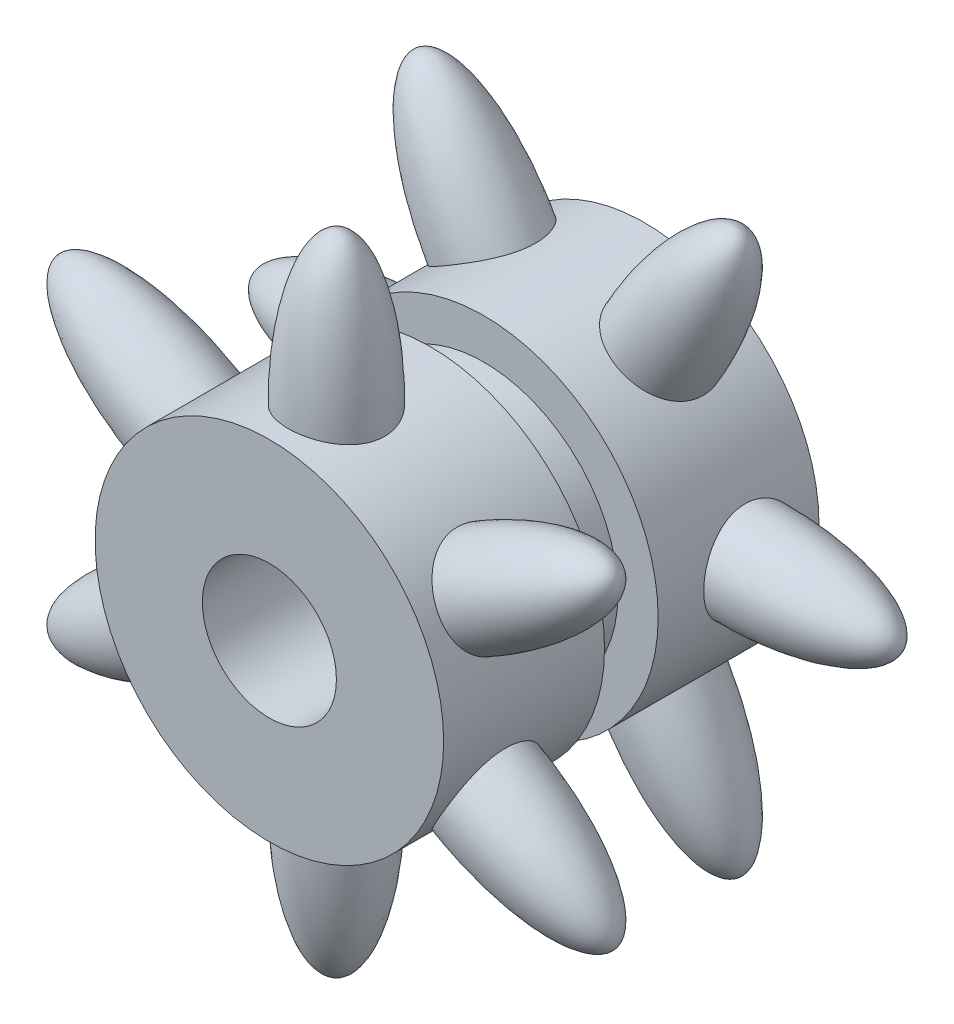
ISO-10303-21;
HEADER;
FILE_DESCRIPTION(('STEP AP214'),'2;1');
FILE_NAME('part.step','',(''),(''),'','','');
FILE_SCHEMA(('AUTOMOTIVE_DESIGN { 1 0 10303 214 1 1 1 1 }'));
ENDSEC;
DATA;
#1=APPLICATION_CONTEXT('core data for automotive mechanical design processes');
#2=APPLICATION_PROTOCOL_DEFINITION('international standard','automotive_design',2000,#1);
#3=PRODUCT_CONTEXT('',#1,'mechanical');
#4=PRODUCT('Part','Part','',(#3));
#5=PRODUCT_RELATED_PRODUCT_CATEGORY('part','',(#4));
#6=PRODUCT_DEFINITION_FORMATION('','',#4);
#7=PRODUCT_DEFINITION_CONTEXT('part definition',#1,'design');
#8=PRODUCT_DEFINITION('design','',#6,#7);
#9=PRODUCT_DEFINITION_SHAPE('','',#8);
#10=(LENGTH_UNIT() NAMED_UNIT(*) SI_UNIT(.MILLI.,.METRE.));
#11=(NAMED_UNIT(*) PLANE_ANGLE_UNIT() SI_UNIT($,.RADIAN.));
#12=(NAMED_UNIT(*) SI_UNIT($,.STERADIAN.) SOLID_ANGLE_UNIT());
#13=UNCERTAINTY_MEASURE_WITH_UNIT(LENGTH_MEASURE(1.E-05),#10,'distance_accuracy_value','');
#14=(GEOMETRIC_REPRESENTATION_CONTEXT(3) GLOBAL_UNCERTAINTY_ASSIGNED_CONTEXT((#13)) GLOBAL_UNIT_ASSIGNED_CONTEXT((#10,
#11,#12)) REPRESENTATION_CONTEXT('',''));
#15=CARTESIAN_POINT('',(0.,0.,0.));
#16=DIRECTION('',(0.,0.,1.));
#17=DIRECTION('',(1.,0.,0.));
#18=AXIS2_PLACEMENT_3D('',#15,#16,#17);
#19=CARTESIAN_POINT('',(0.,0.,3.5));
#20=DIRECTION('',(0.,0.,-1.));
#21=DIRECTION('',(-1.,0.,0.));
#22=AXIS2_PLACEMENT_3D('',#19,#20,#21);
#23=CYLINDRICAL_SURFACE('',#22,3.25);
#24=CARTESIAN_POINT('',(3.12317511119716,-0.89904239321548,-2.25));
#25=CARTESIAN_POINT('',(3.1231758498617,-0.899041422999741,-2.20048754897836));
#26=CARTESIAN_POINT('',(3.12436005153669,-0.894956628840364,-2.15096485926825));
#27=CARTESIAN_POINT('',(3.12895501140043,-0.878754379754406,-2.05334712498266));
#28=CARTESIAN_POINT('',(3.13236672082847,-0.866633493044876,-2.00525269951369));
#29=CARTESIAN_POINT('',(3.14100192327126,-0.834791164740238,-1.91194980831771));
#30=CARTESIAN_POINT('',(3.14622138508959,-0.815086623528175,-1.86673518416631));
#31=CARTESIAN_POINT('',(3.15789487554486,-0.768617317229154,-1.78016922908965));
#32=CARTESIAN_POINT('',(3.16435113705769,-0.741839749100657,-1.73882508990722));
#33=CARTESIAN_POINT('',(3.17795498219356,-0.681239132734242,-1.66018246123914));
#34=CARTESIAN_POINT('',(3.18511536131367,-0.647263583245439,-1.62300366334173));
#35=CARTESIAN_POINT('',(3.19919655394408,-0.573621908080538,-1.55487488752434));
#36=CARTESIAN_POINT('',(3.20611774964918,-0.533965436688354,-1.52391455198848));
#37=CARTESIAN_POINT('',(3.21909002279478,-0.449246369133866,-1.46853908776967));
#38=CARTESIAN_POINT('',(3.22512528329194,-0.404106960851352,-1.44423745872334));
#39=CARTESIAN_POINT('',(3.23550774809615,-0.310190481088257,-1.40360843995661));
#40=CARTESIAN_POINT('',(3.23985524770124,-0.261414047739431,-1.38727965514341));
#41=CARTESIAN_POINT('',(3.24628464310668,-0.162839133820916,-1.36343759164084));
#42=CARTESIAN_POINT('',(3.24841794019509,-0.113092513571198,-1.35572397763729));
#43=CARTESIAN_POINT('',(3.25035953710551,-0.0129681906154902,-1.34869574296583));
#44=CARTESIAN_POINT('',(3.25016823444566,0.0374094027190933,-1.34937968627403));
#45=CARTESIAN_POINT('',(3.24751859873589,0.135990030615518,-1.3589915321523));
#46=CARTESIAN_POINT('',(3.24511884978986,0.18421564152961,-1.36770640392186));
#47=CARTESIAN_POINT('',(3.2383912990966,0.27848960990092,-1.39278943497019));
#48=CARTESIAN_POINT('',(3.23406339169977,0.324537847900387,-1.40915801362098));
#49=CARTESIAN_POINT('',(3.22388007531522,0.413680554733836,-1.44924386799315));
#50=CARTESIAN_POINT('',(3.21801001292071,0.456741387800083,-1.47303207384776));
#51=CARTESIAN_POINT('',(3.20537225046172,0.538326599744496,-1.5272309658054));
#52=CARTESIAN_POINT('',(3.19860437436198,0.576850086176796,-1.55764295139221));
#53=CARTESIAN_POINT('',(3.18465058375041,0.649550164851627,-1.62535858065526));
#54=CARTESIAN_POINT('',(3.17745821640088,0.683551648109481,-1.66284910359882));
#55=CARTESIAN_POINT('',(3.16365556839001,0.744830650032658,-1.74306675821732));
#56=CARTESIAN_POINT('',(3.1570452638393,0.772108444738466,-1.78579367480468));
#57=CARTESIAN_POINT('',(3.14511768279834,0.819350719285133,-1.87571617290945));
#58=CARTESIAN_POINT('',(3.13981068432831,0.839257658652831,-1.92294343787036));
#59=CARTESIAN_POINT('',(3.13120580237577,0.870816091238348,-2.02025160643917));
#60=CARTESIAN_POINT('',(3.12790743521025,0.882469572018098,-2.07033181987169));
#61=CARTESIAN_POINT('',(3.12379916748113,0.896902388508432,-2.17037205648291));
#62=CARTESIAN_POINT('',(3.12292002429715,0.899928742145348,-2.22029362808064));
#63=CARTESIAN_POINT('',(3.12355916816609,0.897707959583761,-2.31993316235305));
#64=CARTESIAN_POINT('',(3.12507719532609,0.892461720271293,-2.36965114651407));
#65=CARTESIAN_POINT('',(3.13027157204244,0.874063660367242,-2.46647107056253));
#66=CARTESIAN_POINT('',(3.13390539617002,0.861067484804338,-2.51360507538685));
#67=CARTESIAN_POINT('',(3.14287951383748,0.827710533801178,-2.60501611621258));
#68=CARTESIAN_POINT('',(3.14822002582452,0.807348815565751,-2.64929278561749));
#69=CARTESIAN_POINT('',(3.16014828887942,0.759332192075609,-2.73477645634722));
#70=CARTESIAN_POINT('',(3.16676021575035,0.731530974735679,-2.77589782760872));
#71=CARTESIAN_POINT('',(3.18043205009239,0.669593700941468,-2.85297269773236));
#72=CARTESIAN_POINT('',(3.18749202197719,0.635456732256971,-2.88892545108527));
#73=CARTESIAN_POINT('',(3.20150889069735,0.560648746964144,-2.95569865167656));
#74=CARTESIAN_POINT('',(3.20845713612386,0.519819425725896,-2.98634391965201));
#75=CARTESIAN_POINT('',(3.22126314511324,0.433436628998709,-3.04034329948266));
#76=CARTESIAN_POINT('',(3.22712096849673,0.387883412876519,-3.06369781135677));
#77=CARTESIAN_POINT('',(3.2370464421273,0.293688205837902,-3.10223219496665));
#78=CARTESIAN_POINT('',(3.24112823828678,0.245074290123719,-3.11747688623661));
#79=CARTESIAN_POINT('',(3.24710584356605,0.145845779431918,-3.13955660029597));
#80=CARTESIAN_POINT('',(3.24900214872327,0.0952316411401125,-3.14639353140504));
#81=CARTESIAN_POINT('',(3.25036969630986,-0.0048541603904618,-3.15133681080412));
#82=CARTESIAN_POINT('',(3.24991524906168,-0.0543117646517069,-3.14971067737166));
#83=CARTESIAN_POINT('',(3.24680266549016,-0.152222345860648,-3.13840075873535));
#84=CARTESIAN_POINT('',(3.24414462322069,-0.200675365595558,-3.12871731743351));
#85=CARTESIAN_POINT('',(3.2369396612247,-0.294851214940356,-3.10172054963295));
#86=CARTESIAN_POINT('',(3.23240718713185,-0.340591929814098,-3.08446551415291));
#87=CARTESIAN_POINT('',(3.22192648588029,-0.428548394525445,-3.042863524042));
#88=CARTESIAN_POINT('',(3.21597806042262,-0.470763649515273,-3.01851557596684));
#89=CARTESIAN_POINT('',(3.20309996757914,-0.551703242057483,-2.96265348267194));
#90=CARTESIAN_POINT('',(3.19614822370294,-0.590303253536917,-2.93096431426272));
#91=CARTESIAN_POINT('',(3.18212985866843,-0.661722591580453,-2.86164713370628));
#92=CARTESIAN_POINT('',(3.17506322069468,-0.694541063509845,-2.82401824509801));
#93=CARTESIAN_POINT('',(3.16142002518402,-0.754244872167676,-2.74282610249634));
#94=CARTESIAN_POINT('',(3.15485888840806,-0.780972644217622,-2.69914416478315));
#95=CARTESIAN_POINT('',(3.1431906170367,-0.826687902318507,-2.60773829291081));
#96=CARTESIAN_POINT('',(3.13808266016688,-0.84567976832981,-2.56001666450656));
#97=CARTESIAN_POINT('',(3.13051646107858,-0.873235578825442,-2.46879922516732));
#98=CARTESIAN_POINT('',(3.12778667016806,-0.882890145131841,-2.42565245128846));
#99=CARTESIAN_POINT('',(3.12411580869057,-0.895793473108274,-2.33833972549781));
#100=CARTESIAN_POINT('',(3.12317445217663,-0.899043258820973,-2.29417393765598));
#101=CARTESIAN_POINT('',(3.12317511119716,-0.89904239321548,-2.25));
#102=B_SPLINE_CURVE_WITH_KNOTS('',3,(#24,#25,#26,#27,#28,#29,#30,#31,#32,#33,#34,#35,#36,#37,
#38,#39,#40,#41,#42,#43,#44,#45,#46,#47,#48,#49,#50,#51,#52,#53,#54,#55,#56,#57,#58,#59,#60,#61,
#62,#63,#64,#65,#66,#67,#68,#69,#70,#71,#72,#73,#74,#75,#76,#77,#78,#79,#80,#81,#82,#83,#84,#85,
#86,#87,#88,#89,#90,#91,#92,#93,#94,#95,#96,#97,#98,#99,#100,#101),.UNSPECIFIED.,.T.,.F.,(4,2,2,
2,2,2,2,2,2,2,2,2,2,2,2,2,2,2,2,2,2,2,2,2,2,2,2,2,2,2,2,2,2,2,2,2,2,2,4),(0.,0.148375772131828,
0.296814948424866,0.444925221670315,0.593305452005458,0.745216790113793,0.89687296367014,
1.05097274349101,1.20504554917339,1.35545572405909,1.50584017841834,1.65234686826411,
1.79886158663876,1.94682226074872,2.09481198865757,2.24746245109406,2.40010664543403,
2.55391851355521,2.7076933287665,2.8570186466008,3.0063277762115,3.15273474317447,
3.29916045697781,3.44870971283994,3.59828051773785,3.75210796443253,3.90592696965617,
4.05849733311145,4.21103306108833,4.35877698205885,4.50651459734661,4.65313425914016,
4.79977446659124,4.95035606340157,5.10095990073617,5.25510317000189,5.4091590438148,
5.54155786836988,5.67393552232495),.UNSPECIFIED.);
#103=CARTESIAN_POINT('',(3.12317511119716,-0.89904239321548,-2.25));
#104=VERTEX_POINT('',#103);
#105=EDGE_CURVE('E87',#104,#104,#102,.T.);
#106=ORIENTED_EDGE('',*,*,#105,.T.);
#107=EDGE_LOOP('',(#106));
#108=FACE_BOUND('',#107,.T.);
#109=CARTESIAN_POINT('',(0.782994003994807,-3.15427018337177,-2.25));
#110=CARTESIAN_POINT('',(0.782995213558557,-3.15427033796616,-2.20048754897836));
#111=CARTESIAN_POINT('',(0.7871248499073,-3.15325348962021,-2.15096485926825));
#112=CARTESIAN_POINT('',(0.803453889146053,-3.1491317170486,-2.05334712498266));
#113=CARTESIAN_POINT('',(0.815656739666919,-3.14602590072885,-2.00525269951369));
#114=CARTESIAN_POINT('',(0.847550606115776,-3.13758304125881,-1.91194980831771));
#115=CARTESIAN_POINT('',(0.867224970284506,-3.13225095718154,-1.86673518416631));
#116=CARTESIAN_POINT('',(0.913305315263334,-3.11912584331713,-1.78016922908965));
#117=CARTESIAN_POINT('',(0.939723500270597,-3.11132834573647,-1.73882508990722));
#118=CARTESIAN_POINT('',(0.999007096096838,-3.09280931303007,-1.66018246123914));
#119=CARTESIAN_POINT('',(1.03201097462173,-3.08202260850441,-1.62300366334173));
#120=CARTESIAN_POINT('',(1.10282713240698,-3.05739644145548,-1.55487488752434));
#121=CARTESIAN_POINT('',(1.14063124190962,-3.04356213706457,-1.52391455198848));
#122=CARTESIAN_POINT('',(1.22048624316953,-3.01243692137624,-1.46853908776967));
#123=CARTESIAN_POINT('',(1.26259574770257,-2.99509390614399,-1.44423745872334));
#124=CARTESIAN_POINT('',(1.34912103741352,-2.95712714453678,-1.40360843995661));
#125=CARTESIAN_POINT('',(1.39353641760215,-2.93650397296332,-1.38727965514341));
#126=CARTESIAN_POINT('',(1.48211949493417,-2.89278453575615,-1.36343759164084));
#127=CARTESIAN_POINT('',(1.52626798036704,-2.86975871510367,-1.35572397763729));
#128=CARTESIAN_POINT('',(1.61394898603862,-2.82137802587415,-1.34869574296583));
#129=CARTESIAN_POINT('',(1.65748161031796,-2.79602355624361,-1.34937968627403));
#130=CARTESIAN_POINT('',(1.7415301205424,-2.74443859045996,-1.3589915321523));
#131=CARTESIAN_POINT('',(1.78209485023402,-2.71824754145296,-1.36770640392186));
#132=CARTESIAN_POINT('',(1.86037472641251,-2.66528432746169,-1.39278943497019));
#133=CARTESIAN_POINT('',(1.89808971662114,-2.63851213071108,-1.40915801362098));
#134=CARTESIAN_POINT('',(1.97019790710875,-2.58512176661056,-1.44924386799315));
#135=CARTESIAN_POINT('',(2.00455465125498,-2.55850772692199,-1.47303207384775));
#136=CARTESIAN_POINT('',(2.06889063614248,-2.5067704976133,-1.5272309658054));
#137=CARTESIAN_POINT('',(2.09886901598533,-2.48164760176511,-1.55764295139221));
#138=CARTESIAN_POINT('',(2.15485223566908,-2.43321322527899,-1.62535858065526));
#139=CARTESIAN_POINT('',(2.18070220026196,-2.40998371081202,-1.66284910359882));
#140=CARTESIAN_POINT('',(2.22687004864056,-2.36739076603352,-1.74306675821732));
#141=CARTESIAN_POINT('',(2.24718815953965,-2.34802717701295,-1.78579367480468));
#142=CARTESIAN_POINT('',(2.28213737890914,-2.31407645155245,-1.87571617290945));
#143=CARTESIAN_POINT('',(2.29672379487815,-2.29952698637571,-1.92294343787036));
#144=CARTESIAN_POINT('',(2.31975175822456,-2.27629572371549,-2.02025160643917));
#145=CARTESIAN_POINT('',(2.32819478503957,-2.26761251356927,-2.07033181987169));
#146=CARTESIAN_POINT('',(2.3386398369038,-2.25683824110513,-2.17037205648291));
#147=CARTESIAN_POINT('',(2.34082116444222,-2.25456370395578,-2.22029362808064));
#148=CARTESIAN_POINT('',(2.33921748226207,-2.25622761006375,-2.31993316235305));
#149=CARTESIAN_POINT('',(2.33543311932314,-2.26016537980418,-2.36965114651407));
#150=CARTESIAN_POINT('',(2.32209712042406,-2.27386287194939,-2.46647107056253));
#151=CARTESIAN_POINT('',(2.31265901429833,-2.28350794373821,-2.51360507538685));
#152=CARTESIAN_POINT('',(2.28825810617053,-2.30795823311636,-2.60501611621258));
#153=CARTESIAN_POINT('',(2.27329459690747,-2.32276411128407,-2.64929278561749));
#154=CARTESIAN_POINT('',(2.23767511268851,-2.3571026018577,-2.73477645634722));
#155=CARTESIAN_POINT('',(2.21690451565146,-2.37672930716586,-2.77589782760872));
#156=CARTESIAN_POINT('',(2.17010118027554,-2.41953809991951,-2.85297269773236));
#157=CARTESIAN_POINT('',(2.14406768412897,-2.442720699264,-2.88892545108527));
#158=CARTESIAN_POINT('',(2.08629050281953,-2.49226365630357,-2.95569865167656));
#159=CARTESIAN_POINT('',(2.05440539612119,-2.51869567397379,-2.98634391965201));
#160=CARTESIAN_POINT('',(1.98599870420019,-2.57297740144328,-3.04034329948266));
#161=CARTESIAN_POINT('',(1.94947737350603,-2.60082703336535,-3.06369781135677));
#162=CARTESIAN_POINT('',(1.87286466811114,-2.65652034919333,-3.10223219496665));
#163=CARTESIAN_POINT('',(1.83280468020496,-2.6843622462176,-3.11747688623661));
#164=CARTESIAN_POINT('',(1.7498590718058,-2.73915325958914,-3.13955660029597));
#165=CARTESIAN_POINT('',(1.70697409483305,-2.76610257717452,-3.14639353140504));
#166=CARTESIAN_POINT('',(1.62098102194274,-2.81732980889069,-3.15133681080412));
#167=CARTESIAN_POINT('',(1.57792225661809,-2.8416650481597,-3.14971067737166));
#168=CARTESIAN_POINT('',(1.49157291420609,-2.88792476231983,-3.13840075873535));
#169=CARTESIAN_POINT('',(1.44828234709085,-2.90984934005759,-3.12871731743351));
#170=CARTESIAN_POINT('',(1.36312118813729,-2.95069758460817,-3.10172054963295));
#171=CARTESIAN_POINT('',(1.32124233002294,-2.96964270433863,-3.08446551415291));
#172=CARTESIAN_POINT('',(1.23982944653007,-3.00454438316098,-3.042863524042));
#173=CARTESIAN_POINT('',(1.2002957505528,-3.02050052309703,-3.01851557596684));
#174=CARTESIAN_POINT('',(1.12376096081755,-3.04981756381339,-2.96265348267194));
#175=CARTESIAN_POINT('',(1.08685649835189,-3.06309718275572,-2.93096431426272));
#176=CARTESIAN_POINT('',(1.01799635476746,-3.08666659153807,-2.86164713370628));
#177=CARTESIAN_POINT('',(0.986041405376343,-3.09695593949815,-2.82401824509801));
#178=CARTESIAN_POINT('',(0.927514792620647,-3.11499248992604,-2.74282610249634));
#179=CARTESIAN_POINT('',(0.901087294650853,-3.12267426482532,-2.69914416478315));
#180=CARTESIAN_POINT('',(0.855662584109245,-3.13542687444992,-2.60773829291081));
#181=CARTESIAN_POINT('',(0.836661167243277,-3.14049918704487,-2.56001666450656));
#182=CARTESIAN_POINT('',(0.809014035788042,-3.14772457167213,-2.46879922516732));
#183=CARTESIAN_POINT('',(0.79928804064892,-3.1501877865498,-2.42565245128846));
#184=CARTESIAN_POINT('',(0.786278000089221,-3.15346039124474,-2.33833972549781));
#185=CARTESIAN_POINT('',(0.782992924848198,-3.154270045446,-2.29417393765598));
#186=CARTESIAN_POINT('',(0.782994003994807,-3.15427018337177,-2.25));
#187=B_SPLINE_CURVE_WITH_KNOTS('',3,(#109,#110,#111,#112,#113,#114,#115,#116,#117,#118,#119,
#120,#121,#122,#123,#124,#125,#126,#127,#128,#129,#130,#131,#132,#133,#134,#135,#136,#137,#138,
#139,#140,#141,#142,#143,#144,#145,#146,#147,#148,#149,#150,#151,#152,#153,#154,#155,#156,#157,
#158,#159,#160,#161,#162,#163,#164,#165,#166,#167,#168,#169,#170,#171,#172,#173,#174,#175,#176,
#177,#178,#179,#180,#181,#182,#183,#184,#185,#186),.UNSPECIFIED.,.T.,.F.,(4,2,2,2,2,2,2,2,2,2,2,
2,2,2,2,2,2,2,2,2,2,2,2,2,2,2,2,2,2,2,2,2,2,2,2,2,2,2,4),(0.,0.148375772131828,
0.296814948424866,0.444925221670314,0.593305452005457,0.745216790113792,0.89687296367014,
1.05097274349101,1.20504554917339,1.35545572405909,1.50584017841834,1.65234686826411,
1.79886158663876,1.94682226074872,2.09481198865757,2.24746245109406,2.40010664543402,
2.55391851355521,2.7076933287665,2.8570186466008,3.0063277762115,3.15273474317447,
3.29916045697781,3.44870971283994,3.59828051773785,3.75210796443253,3.90592696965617,
4.05849733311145,4.21103306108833,4.35877698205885,4.50651459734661,4.65313425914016,
4.79977446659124,4.95035606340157,5.10095990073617,5.25510317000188,5.4091590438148,
5.54155786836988,5.67393552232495),.UNSPECIFIED.);
#188=CARTESIAN_POINT('',(0.782994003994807,-3.15427018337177,-2.25));
#189=VERTEX_POINT('',#188);
#190=EDGE_CURVE('E89',#189,#189,#187,.T.);
#191=ORIENTED_EDGE('',*,*,#190,.T.);
#192=EDGE_LOOP('',(#191));
#193=FACE_BOUND('',#192,.T.);
#194=CARTESIAN_POINT('',(-2.34018110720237,-2.25522779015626,-2.25));
#195=CARTESIAN_POINT('',(-2.34018063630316,-2.25522891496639,-2.20048754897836));
#196=CARTESIAN_POINT('',(-2.33723520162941,-2.25829686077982,-2.15096485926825));
#197=CARTESIAN_POINT('',(-2.32550112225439,-2.27037733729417,-2.05334712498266));
#198=CARTESIAN_POINT('',(-2.31670998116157,-2.27939240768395,-2.00525269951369));
#199=CARTESIAN_POINT('',(-2.2934513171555,-2.30279187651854,-1.91194980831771));
#200=CARTESIAN_POINT('',(-2.27899641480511,-2.31716433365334,-1.86673518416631));
#201=CARTESIAN_POINT('',(-2.24458956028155,-2.35050852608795,-1.78016922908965));
#202=CARTESIAN_POINT('',(-2.22462763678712,-2.36948859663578,-1.73882508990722));
#203=CARTESIAN_POINT('',(-2.17894788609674,-2.4115701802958,-1.66018246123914));
#204=CARTESIAN_POINT('',(-2.15310438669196,-2.43475902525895,-1.62300366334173));
#205=CARTESIAN_POINT('',(-2.09636942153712,-2.48377453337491,-1.55487488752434));
#206=CARTESIAN_POINT('',(-2.06548650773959,-2.50959670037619,-1.52391455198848));
#207=CARTESIAN_POINT('',(-1.99860377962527,-2.56319055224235,-1.46853908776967));
#208=CARTESIAN_POINT('',(-1.9625295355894,-2.59098694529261,-1.44423745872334));
#209=CARTESIAN_POINT('',(-1.88638671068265,-2.6469366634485,-1.40360843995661));
#210=CARTESIAN_POINT('',(-1.84631883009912,-2.67508992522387,-1.38727965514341));
#211=CARTESIAN_POINT('',(-1.76416514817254,-2.7299454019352,-1.36343759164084));
#212=CARTESIAN_POINT('',(-1.72214995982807,-2.75666620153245,-1.35572397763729));
#213=CARTESIAN_POINT('',(-1.63641055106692,-2.80840983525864,-1.34869574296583));
#214=CARTESIAN_POINT('',(-1.59268662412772,-2.83343295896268,-1.34937968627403));
#215=CARTESIAN_POINT('',(-1.50598847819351,-2.88042862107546,-1.3589915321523));
#216=CARTESIAN_POINT('',(-1.46302399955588,-2.90246318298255,-1.36770640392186));
#217=CARTESIAN_POINT('',(-1.37801657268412,-2.94377393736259,-1.39278943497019));
#218=CARTESIAN_POINT('',(-1.33597367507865,-2.96304997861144,-1.40915801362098));
#219=CARTESIAN_POINT('',(-1.2536821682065,-2.99880232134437,-1.44924386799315));
#220=CARTESIAN_POINT('',(-1.21345536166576,-3.01524911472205,-1.47303207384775));
#221=CARTESIAN_POINT('',(-1.13648161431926,-3.04509709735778,-1.5272309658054));
#222=CARTESIAN_POINT('',(-1.09973535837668,-3.05849768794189,-1.55764295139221));
#223=CARTESIAN_POINT('',(-1.02979834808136,-3.0827633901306,-1.62535858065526));
#224=CARTESIAN_POINT('',(-0.996756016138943,-3.09353535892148,-1.66284910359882));
#225=CARTESIAN_POINT('',(-0.936785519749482,-3.11222141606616,-1.74306675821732));
#226=CARTESIAN_POINT('',(-0.909857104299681,-3.1201356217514,-1.78579367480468));
#227=CARTESIAN_POINT('',(-0.862980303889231,-3.13342717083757,-1.87571617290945));
#228=CARTESIAN_POINT('',(-0.843086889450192,-3.13878464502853,-1.92294343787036));
#229=CARTESIAN_POINT('',(-0.811454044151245,-3.14711181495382,-2.02025160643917));
#230=CARTESIAN_POINT('',(-0.79971265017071,-3.15008208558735,-2.07033181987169));
#231=CARTESIAN_POINT('',(-0.785159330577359,-3.15374062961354,-2.17037205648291));
#232=CARTESIAN_POINT('',(-0.782098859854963,-3.15449244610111,-2.22029362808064));
#233=CARTESIAN_POINT('',(-0.784341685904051,-3.1539355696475,-2.31993316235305));
#234=CARTESIAN_POINT('',(-0.789644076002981,-3.15262710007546,-2.36965114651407));
#235=CARTESIAN_POINT('',(-0.808174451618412,-3.14792653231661,-2.46647107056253));
#236=CARTESIAN_POINT('',(-0.821246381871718,-3.14457542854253,-2.51360507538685));
#237=CARTESIAN_POINT('',(-0.854621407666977,-3.13566876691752,-2.60501611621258));
#238=CARTESIAN_POINT('',(-0.87492542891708,-3.13011292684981,-2.64929278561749));
#239=CARTESIAN_POINT('',(-0.922473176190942,-3.1164347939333,-2.73477645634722));
#240=CARTESIAN_POINT('',(-0.949855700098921,-3.10826028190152,-2.77589782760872));
#241=CARTESIAN_POINT('',(-1.01033086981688,-3.08913180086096,-2.85297269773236));
#242=CARTESIAN_POINT('',(-1.04342433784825,-3.07817743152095,-2.88892545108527));
#243=CARTESIAN_POINT('',(-1.11521838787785,-3.0529124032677,-2.95569865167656));
#244=CARTESIAN_POINT('',(-1.1540517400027,-3.03851509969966,-2.98634391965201));
#245=CARTESIAN_POINT('',(-1.23526444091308,-3.00641403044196,-3.04034329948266));
#246=CARTESIAN_POINT('',(-1.27764359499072,-2.98871044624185,-3.06369781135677));
#247=CARTESIAN_POINT('',(-1.36418177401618,-2.95020855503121,-3.10223219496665));
#248=CARTESIAN_POINT('',(-1.40832355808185,-2.9294365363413,-3.11747688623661));
#249=CARTESIAN_POINT('',(-1.49724677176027,-2.88499903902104,-3.13955660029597));
#250=CARTESIAN_POINT('',(-1.54202805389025,-2.86133421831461,-3.14639353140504));
#251=CARTESIAN_POINT('',(-1.62938867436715,-2.81247564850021,-3.15133681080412));
#252=CARTESIAN_POINT('',(-1.67199299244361,-2.78735328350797,-3.14971067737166));
#253=CARTESIAN_POINT('',(-1.75522975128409,-2.73570241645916,-3.13840075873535));
#254=CARTESIAN_POINT('',(-1.79586227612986,-2.70917397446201,-3.12871731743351));
#255=CARTESIAN_POINT('',(-1.87381847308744,-2.65584636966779,-3.10172054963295));
#256=CARTESIAN_POINT('',(-1.91116485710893,-2.62905077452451,-3.08446551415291));
#257=CARTESIAN_POINT('',(-1.98209703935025,-2.57599598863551,-3.042863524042));
#258=CARTESIAN_POINT('',(-2.01568230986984,-2.54973687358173,-3.01851557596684));
#259=CARTESIAN_POINT('',(-2.07933900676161,-2.49811432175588,-2.96265348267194));
#260=CARTESIAN_POINT('',(-2.10929172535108,-2.47279392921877,-2.93096431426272));
#261=CARTESIAN_POINT('',(-2.16413350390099,-2.42494399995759,-2.86164713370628));
#262=CARTESIAN_POINT('',(-2.18902181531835,-2.40241487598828,-2.82401824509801));
#263=CARTESIAN_POINT('',(-2.23390523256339,-2.36074761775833,-2.74282610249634));
#264=CARTESIAN_POINT('',(-2.25377159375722,-2.34170162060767,-2.69914416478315));
#265=CARTESIAN_POINT('',(-2.28752803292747,-2.30873897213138,-2.60773829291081));
#266=CARTESIAN_POINT('',(-2.30142149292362,-2.29481941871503,-2.56001666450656));
#267=CARTESIAN_POINT('',(-2.32150242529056,-2.27448899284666,-2.46879922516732));
#268=CARTESIAN_POINT('',(-2.32849862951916,-2.26729764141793,-2.42565245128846));
#269=CARTESIAN_POINT('',(-2.33783780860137,-2.25766691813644,-2.33833972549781));
#270=CARTESIAN_POINT('',(-2.34018152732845,-2.255226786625,-2.29417393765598));
#271=CARTESIAN_POINT('',(-2.34018110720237,-2.25522779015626,-2.25));
#272=B_SPLINE_CURVE_WITH_KNOTS('',3,(#194,#195,#196,#197,#198,#199,#200,#201,#202,#203,#204,
#205,#206,#207,#208,#209,#210,#211,#212,#213,#214,#215,#216,#217,#218,#219,#220,#221,#222,#223,
#224,#225,#226,#227,#228,#229,#230,#231,#232,#233,#234,#235,#236,#237,#238,#239,#240,#241,#242,
#243,#244,#245,#246,#247,#248,#249,#250,#251,#252,#253,#254,#255,#256,#257,#258,#259,#260,#261,
#262,#263,#264,#265,#266,#267,#268,#269,#270,#271),.UNSPECIFIED.,.T.,.F.,(4,2,2,2,2,2,2,2,2,2,2,
2,2,2,2,2,2,2,2,2,2,2,2,2,2,2,2,2,2,2,2,2,2,2,2,2,2,2,4),(0.,0.148375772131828,
0.296814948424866,0.444925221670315,0.593305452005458,0.745216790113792,0.89687296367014,
1.05097274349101,1.20504554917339,1.35545572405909,1.50584017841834,1.65234686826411,
1.79886158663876,1.94682226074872,2.09481198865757,2.24746245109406,2.40010664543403,
2.55391851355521,2.7076933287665,2.8570186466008,3.0063277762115,3.15273474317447,
3.29916045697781,3.44870971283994,3.59828051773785,3.75210796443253,3.90592696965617,
4.05849733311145,4.21103306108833,4.35877698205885,4.50651459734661,4.65313425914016,
4.79977446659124,4.95035606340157,5.10095990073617,5.25510317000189,5.4091590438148,
5.54155786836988,5.67393552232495),.UNSPECIFIED.);
#273=CARTESIAN_POINT('',(-2.34018110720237,-2.25522779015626,-2.25));
#274=VERTEX_POINT('',#273);
#275=EDGE_CURVE('E92',#274,#274,#272,.T.);
#276=ORIENTED_EDGE('',*,*,#275,.T.);
#277=EDGE_LOOP('',(#276));
#278=FACE_BOUND('',#277,.T.);
#279=CARTESIAN_POINT('',(-3.25,0.,-1.35));
#280=CARTESIAN_POINT('',(-3.24999935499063,-0.0494456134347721,-1.35000096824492));
#281=CARTESIAN_POINT('',(-3.24886064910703,-0.0989015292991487,-1.35408805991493));
#282=CARTESIAN_POINT('',(-3.24442846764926,-0.196388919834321,-1.37029972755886));
#283=CARTESIAN_POINT('',(-3.24113410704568,-0.244419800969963,-1.38242760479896));
#284=CARTESIAN_POINT('',(-3.23275587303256,-0.337601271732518,-1.4142877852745));
#285=CARTESIAN_POINT('',(-3.22767583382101,-0.38275778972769,-1.43400380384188));
#286=CARTESIAN_POINT('',(-3.21624882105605,-0.46920175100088,-1.48049054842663));
#287=CARTESIAN_POINT('',(-3.20989957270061,-0.510482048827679,-1.50727396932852));
#288=CARTESIAN_POINT('',(-3.19644790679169,-0.588932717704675,-1.56782289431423));
#289=CARTESIAN_POINT('',(-3.18933183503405,-0.625990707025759,-1.60173097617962));
#290=CARTESIAN_POINT('',(-3.17524815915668,-0.693903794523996,-1.67519326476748));
#291=CARTESIAN_POINT('',(-3.16828033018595,-0.724768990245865,-1.71473809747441));
#292=CARTESIAN_POINT('',(-3.15512131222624,-0.780087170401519,-1.79932657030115));
#293=CARTESIAN_POINT('',(-3.14894768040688,-0.804405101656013,-1.84446150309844));
#294=CARTESIAN_POINT('',(-3.13827593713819,-0.845085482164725,-1.93836930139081));
#295=CARTESIAN_POINT('',(-3.13377753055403,-0.861449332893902,-1.98714152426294));
#296=CARTESIAN_POINT('',(-3.12709086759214,-0.885412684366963,-2.08583448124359));
#297=CARTESIAN_POINT('',(-3.12485505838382,-0.893192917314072,-2.13570803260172));
#298=CARTESIAN_POINT('',(-3.12280477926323,-0.900336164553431,-2.23609950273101));
#299=CARTESIAN_POINT('',(-3.12298985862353,-0.899700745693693,-2.28661729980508));
#300=CARTESIAN_POINT('',(-3.12571759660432,-0.890175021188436,-2.38537983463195));
#301=CARTESIAN_POINT('',(-3.12819477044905,-0.881513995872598,-2.43364876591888));
#302=CARTESIAN_POINT('',(-3.13512189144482,-0.856549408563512,-2.5280172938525));
#303=CARTESIAN_POINT('',(-3.13957199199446,-0.840245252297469,-2.57411672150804));
#304=CARTESIAN_POINT('',(-3.1499940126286,-0.800291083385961,-2.66337754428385));
#305=CARTESIAN_POINT('',(-3.15598058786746,-0.776569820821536,-2.70650526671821));
#306=CARTESIAN_POINT('',(-3.168807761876,-0.722447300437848,-2.78831108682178));
#307=CARTESIAN_POINT('',(-3.17564994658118,-0.692033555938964,-2.8269806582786));
#308=CARTESIAN_POINT('',(-3.18967845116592,-0.62424734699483,-2.89999305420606));
#309=CARTESIAN_POINT('',(-3.19686876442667,-0.5866826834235,-2.93415692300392));
#310=CARTESIAN_POINT('',(-3.21057379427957,-0.506331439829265,-2.99566913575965));
#311=CARTESIAN_POINT('',(-3.2170896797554,-0.46355418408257,-3.02302939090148));
#312=CARTESIAN_POINT('',(-3.22877009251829,-0.37363863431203,-3.07033004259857));
#313=CARTESIAN_POINT('',(-3.23392816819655,-0.326480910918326,-3.09023519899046));
#314=CARTESIAN_POINT('',(-3.24226594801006,-0.229315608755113,-3.12178978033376));
#315=CARTESIAN_POINT('',(-3.24544609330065,-0.179308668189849,-3.1334410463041));
#316=CARTESIAN_POINT('',(-3.24940147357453,-0.0794524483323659,-3.14786244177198));
#317=CARTESIAN_POINT('',(-3.25024510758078,-0.0296423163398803,-3.15088524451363));
#318=CARTESIAN_POINT('',(-3.2496309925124,0.069775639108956,-3.14866728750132));
#319=CARTESIAN_POINT('',(-3.24817349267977,0.119383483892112,-3.14342742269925));
#320=CARTESIAN_POINT('',(-3.24316458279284,0.216072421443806,-3.12503576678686));
#321=CARTESIAN_POINT('',(-3.23965097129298,0.263182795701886,-3.11202671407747));
#322=CARTESIAN_POINT('',(-3.23092981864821,0.354542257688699,-3.07863086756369));
#323=CARTESIAN_POINT('',(-3.22572209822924,0.398791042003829,-3.0582432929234));
#324=CARTESIAN_POINT('',(-3.21403331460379,0.484130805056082,-3.0102149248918));
#325=CARTESIAN_POINT('',(-3.20752936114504,0.525143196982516,-2.98244020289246));
#326=CARTESIAN_POINT('',(-3.19399632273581,0.602007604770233,-2.92058952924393));
#327=CARTESIAN_POINT('',(-3.18696715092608,0.637858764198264,-2.88651253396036));
#328=CARTESIAN_POINT('',(-3.17291806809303,0.704475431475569,-2.81183558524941));
#329=CARTESIAN_POINT('',(-3.16590446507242,0.73506111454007,-2.77107374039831));
#330=CARTESIAN_POINT('',(-3.152901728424,0.788975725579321,-2.68485264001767));
#331=CARTESIAN_POINT('',(-3.14691256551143,0.812304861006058,-2.63939351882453));
#332=CARTESIAN_POINT('',(-3.13669276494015,0.850916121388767,-2.54520894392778));
#333=CARTESIAN_POINT('',(-3.13245487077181,0.866231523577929,-2.4964979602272));
#334=CARTESIAN_POINT('',(-3.12622893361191,0.88844139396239,-2.39705726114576));
#335=CARTESIAN_POINT('',(-3.12424032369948,0.895337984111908,-2.34632805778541));
#336=CARTESIAN_POINT('',(-3.12278967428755,0.90038366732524,-2.24604177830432));
#337=CARTESIAN_POINT('',(-3.12324843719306,0.898806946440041,-2.19649947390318));
#338=CARTESIAN_POINT('',(-3.12645319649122,0.887594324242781,-2.09841445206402));
#339=CARTESIAN_POINT('',(-3.12919912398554,0.877958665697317,-2.04987170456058));
#340=CARTESIAN_POINT('',(-3.13661888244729,0.851065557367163,-1.95555626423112));
#341=CARTESIAN_POINT('',(-3.14127623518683,0.833873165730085,-1.90976363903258));
#342=CARTESIAN_POINT('',(-3.15199336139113,0.792397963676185,-1.82168921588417));
#343=CARTESIAN_POINT('',(-3.15805335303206,0.768114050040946,-1.77940796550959));
#344=CARTESIAN_POINT('',(-3.17111110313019,0.712317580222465,-1.69824266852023));
#345=CARTESIAN_POINT('',(-3.17813080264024,0.680617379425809,-1.65949113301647));
#346=CARTESIAN_POINT('',(-3.1922010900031,0.611230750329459,-1.58778083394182));
#347=CARTESIAN_POINT('',(-3.19925168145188,0.573543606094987,-1.55482276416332));
#348=CARTESIAN_POINT('',(-3.21277006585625,0.492278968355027,-1.49493783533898));
#349=CARTESIAN_POINT('',(-3.2192223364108,0.448593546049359,-1.4681536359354));
#350=CARTESIAN_POINT('',(-3.23064245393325,0.357163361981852,-1.42234750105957));
#351=CARTESIAN_POINT('',(-3.23561115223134,0.309420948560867,-1.40332111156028));
#352=CARTESIAN_POINT('',(-3.24293672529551,0.218277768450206,-1.37576693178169));
#353=CARTESIAN_POINT('',(-3.24556540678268,0.17523181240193,-1.36612724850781));
#354=CARTESIAN_POINT('',(-3.2490972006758,0.0881265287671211,-1.35324383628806));
#355=CARTESIAN_POINT('',(-3.25000057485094,0.0440673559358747,-1.34999913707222));
#356=CARTESIAN_POINT('',(-3.25,0.,-1.35));
#357=B_SPLINE_CURVE_WITH_KNOTS('',3,(#279,#280,#281,#282,#283,#284,#285,#286,#287,#288,#289,
#290,#291,#292,#293,#294,#295,#296,#297,#298,#299,#300,#301,#302,#303,#304,#305,#306,#307,#308,
#309,#310,#311,#312,#313,#314,#315,#316,#317,#318,#319,#320,#321,#322,#323,#324,#325,#326,#327,
#328,#329,#330,#331,#332,#333,#334,#335,#336,#337,#338,#339,#340,#341,#342,#343,#344,#345,#346,
#347,#348,#349,#350,#351,#352,#353,#354,#355,#356),.UNSPECIFIED.,.T.,.F.,(4,2,2,2,2,2,2,2,2,2,2,
2,2,2,2,2,2,2,2,2,2,2,2,2,2,2,2,2,2,2,2,2,2,2,2,2,2,2,4),(0.,0.14817578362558,0.296412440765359,
0.444332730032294,0.592520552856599,0.744017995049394,0.895266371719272,1.04942987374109,
1.20356620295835,1.35439122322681,1.50518816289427,1.65180561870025,1.79843447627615,
1.94651754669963,2.09487928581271,2.24800826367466,2.40086723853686,2.55443991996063,
2.70797833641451,2.85697201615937,3.00594955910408,3.15227077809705,3.29860748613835,
3.44780327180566,3.59702378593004,3.75061723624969,3.90420629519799,4.05715240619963,
4.21005995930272,4.35805001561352,4.50603561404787,4.65277138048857,4.79952998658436,
4.95050521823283,5.10149851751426,5.25569257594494,5.40979798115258,5.54187655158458,
5.67393508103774),.UNSPECIFIED.);
#358=CARTESIAN_POINT('',(-3.25,0.,-1.35));
#359=VERTEX_POINT('',#358);
#360=EDGE_CURVE('E121',#359,#359,#357,.T.);
#361=ORIENTED_EDGE('',*,*,#360,.T.);
#362=EDGE_LOOP('',(#361));
#363=FACE_BOUND('',#362,.T.);
#364=CARTESIAN_POINT('',(-0.782994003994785,3.15427018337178,-2.25));
#365=CARTESIAN_POINT('',(-0.782995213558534,3.15427033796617,-2.20048754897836));
#366=CARTESIAN_POINT('',(-0.787124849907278,3.15325348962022,-2.15096485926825));
#367=CARTESIAN_POINT('',(-0.803453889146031,3.14913171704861,-2.05334712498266));
#368=CARTESIAN_POINT('',(-0.815656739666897,3.14602590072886,-2.00525269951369));
#369=CARTESIAN_POINT('',(-0.847550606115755,3.13758304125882,-1.91194980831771));
#370=CARTESIAN_POINT('',(-0.867224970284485,3.13225095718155,-1.86673518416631));
#371=CARTESIAN_POINT('',(-0.913305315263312,3.11912584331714,-1.78016922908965));
#372=CARTESIAN_POINT('',(-0.939723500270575,3.11132834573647,-1.73882508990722));
#373=CARTESIAN_POINT('',(-0.999007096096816,3.09280931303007,-1.66018246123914));
#374=CARTESIAN_POINT('',(-1.03201097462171,3.08202260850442,-1.62300366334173));
#375=CARTESIAN_POINT('',(-1.10282713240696,3.05739644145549,-1.55487488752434));
#376=CARTESIAN_POINT('',(-1.1406312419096,3.04356213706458,-1.52391455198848));
#377=CARTESIAN_POINT('',(-1.22048624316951,3.01243692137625,-1.46853908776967));
#378=CARTESIAN_POINT('',(-1.26259574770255,2.995093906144,-1.44423745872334));
#379=CARTESIAN_POINT('',(-1.3491210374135,2.95712714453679,-1.40360843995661));
#380=CARTESIAN_POINT('',(-1.39353641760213,2.93650397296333,-1.38727965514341));
#381=CARTESIAN_POINT('',(-1.48211949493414,2.89278453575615,-1.36343759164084));
#382=CARTESIAN_POINT('',(-1.52626798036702,2.86975871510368,-1.35572397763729));
#383=CARTESIAN_POINT('',(-1.6139489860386,2.82137802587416,-1.34869574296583));
#384=CARTESIAN_POINT('',(-1.65748161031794,2.79602355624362,-1.34937968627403));
#385=CARTESIAN_POINT('',(-1.74153012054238,2.74443859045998,-1.3589915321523));
#386=CARTESIAN_POINT('',(-1.782094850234,2.71824754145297,-1.36770640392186));
#387=CARTESIAN_POINT('',(-1.86037472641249,2.6652843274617,-1.39278943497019));
#388=CARTESIAN_POINT('',(-1.89808971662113,2.63851213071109,-1.40915801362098));
#389=CARTESIAN_POINT('',(-1.97019790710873,2.58512176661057,-1.44924386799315));
#390=CARTESIAN_POINT('',(-2.00455465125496,2.558507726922,-1.47303207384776));
#391=CARTESIAN_POINT('',(-2.06889063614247,2.50677049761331,-1.5272309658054));
#392=CARTESIAN_POINT('',(-2.09886901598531,2.48164760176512,-1.55764295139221));
#393=CARTESIAN_POINT('',(-2.15485223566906,2.43321322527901,-1.62535858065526));
#394=CARTESIAN_POINT('',(-2.18070220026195,2.40998371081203,-1.66284910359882));
#395=CARTESIAN_POINT('',(-2.22687004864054,2.36739076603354,-1.74306675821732));
#396=CARTESIAN_POINT('',(-2.24718815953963,2.34802717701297,-1.78579367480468));
#397=CARTESIAN_POINT('',(-2.28213737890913,2.31407645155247,-1.87571617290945));
#398=CARTESIAN_POINT('',(-2.29672379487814,2.29952698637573,-1.92294343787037));
#399=CARTESIAN_POINT('',(-2.31975175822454,2.2762957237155,-2.02025160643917));
#400=CARTESIAN_POINT('',(-2.32819478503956,2.26761251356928,-2.07033181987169));
#401=CARTESIAN_POINT('',(-2.33863983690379,2.25683824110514,-2.17037205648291));
#402=CARTESIAN_POINT('',(-2.3408211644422,2.25456370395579,-2.22029362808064));
#403=CARTESIAN_POINT('',(-2.33921748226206,2.25622761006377,-2.31993316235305));
#404=CARTESIAN_POINT('',(-2.33543311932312,2.26016537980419,-2.36965114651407));
#405=CARTESIAN_POINT('',(-2.32209712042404,2.2738628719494,-2.46647107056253));
#406=CARTESIAN_POINT('',(-2.31265901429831,2.28350794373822,-2.51360507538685));
#407=CARTESIAN_POINT('',(-2.28825810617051,2.30795823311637,-2.60501611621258));
#408=CARTESIAN_POINT('',(-2.27329459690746,2.32276411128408,-2.64929278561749));
#409=CARTESIAN_POINT('',(-2.23767511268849,2.35710260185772,-2.73477645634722));
#410=CARTESIAN_POINT('',(-2.21690451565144,2.37672930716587,-2.77589782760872));
#411=CARTESIAN_POINT('',(-2.17010118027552,2.41953809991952,-2.85297269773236));
#412=CARTESIAN_POINT('',(-2.14406768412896,2.44272069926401,-2.88892545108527));
#413=CARTESIAN_POINT('',(-2.08629050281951,2.49226365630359,-2.95569865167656));
#414=CARTESIAN_POINT('',(-2.05440539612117,2.5186956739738,-2.98634391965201));
#415=CARTESIAN_POINT('',(-1.98599870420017,2.57297740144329,-3.04034329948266));
#416=CARTESIAN_POINT('',(-1.94947737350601,2.60082703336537,-3.06369781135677));
#417=CARTESIAN_POINT('',(-1.87286466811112,2.65652034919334,-3.10223219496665));
#418=CARTESIAN_POINT('',(-1.83280468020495,2.68436224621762,-3.11747688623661));
#419=CARTESIAN_POINT('',(-1.74985907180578,2.73915325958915,-3.13955660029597));
#420=CARTESIAN_POINT('',(-1.70697409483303,2.76610257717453,-3.14639353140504));
#421=CARTESIAN_POINT('',(-1.62098102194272,2.8173298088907,-3.15133681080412));
#422=CARTESIAN_POINT('',(-1.57792225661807,2.84166504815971,-3.14971067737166));
#423=CARTESIAN_POINT('',(-1.49157291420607,2.88792476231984,-3.13840075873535));
#424=CARTESIAN_POINT('',(-1.44828234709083,2.9098493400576,-3.12871731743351));
#425=CARTESIAN_POINT('',(-1.36312118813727,2.95069758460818,-3.10172054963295));
#426=CARTESIAN_POINT('',(-1.32124233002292,2.96964270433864,-3.08446551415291));
#427=CARTESIAN_POINT('',(-1.23982944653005,3.00454438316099,-3.042863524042));
#428=CARTESIAN_POINT('',(-1.20029575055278,3.02050052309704,-3.01851557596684));
#429=CARTESIAN_POINT('',(-1.12376096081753,3.0498175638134,-2.96265348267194));
#430=CARTESIAN_POINT('',(-1.08685649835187,3.06309718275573,-2.93096431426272));
#431=CARTESIAN_POINT('',(-1.01799635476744,3.08666659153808,-2.86164713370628));
#432=CARTESIAN_POINT('',(-0.986041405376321,3.09695593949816,-2.82401824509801));
#433=CARTESIAN_POINT('',(-0.927514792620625,3.11499248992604,-2.74282610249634));
#434=CARTESIAN_POINT('',(-0.901087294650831,3.12267426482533,-2.69914416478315));
#435=CARTESIAN_POINT('',(-0.855662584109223,3.13542687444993,-2.60773829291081));
#436=CARTESIAN_POINT('',(-0.836661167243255,3.14049918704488,-2.56001666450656));
#437=CARTESIAN_POINT('',(-0.80901403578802,3.14772457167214,-2.46879922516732));
#438=CARTESIAN_POINT('',(-0.799288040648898,3.15018778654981,-2.42565245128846));
#439=CARTESIAN_POINT('',(-0.786278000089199,3.15346039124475,-2.33833972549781));
#440=CARTESIAN_POINT('',(-0.782992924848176,3.15427004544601,-2.29417393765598));
#441=CARTESIAN_POINT('',(-0.782994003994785,3.15427018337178,-2.25));
#442=B_SPLINE_CURVE_WITH_KNOTS('',3,(#364,#365,#366,#367,#368,#369,#370,#371,#372,#373,#374,
#375,#376,#377,#378,#379,#380,#381,#382,#383,#384,#385,#386,#387,#388,#389,#390,#391,#392,#393,
#394,#395,#396,#397,#398,#399,#400,#401,#402,#403,#404,#405,#406,#407,#408,#409,#410,#411,#412,
#413,#414,#415,#416,#417,#418,#419,#420,#421,#422,#423,#424,#425,#426,#427,#428,#429,#430,#431,
#432,#433,#434,#435,#436,#437,#438,#439,#440,#441),.UNSPECIFIED.,.T.,.F.,(4,2,2,2,2,2,2,2,2,2,2,
2,2,2,2,2,2,2,2,2,2,2,2,2,2,2,2,2,2,2,2,2,2,2,2,2,2,2,4),(0.,0.148375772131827,
0.296814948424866,0.444925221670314,0.593305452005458,0.745216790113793,0.89687296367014,
1.05097274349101,1.20504554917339,1.35545572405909,1.50584017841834,1.65234686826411,
1.79886158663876,1.94682226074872,2.09481198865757,2.24746245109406,2.40010664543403,
2.55391851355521,2.7076933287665,2.8570186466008,3.0063277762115,3.15273474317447,
3.29916045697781,3.44870971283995,3.59828051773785,3.75210796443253,3.90592696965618,
4.05849733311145,4.21103306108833,4.35877698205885,4.50651459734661,4.65313425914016,
4.79977446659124,4.95035606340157,5.10095990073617,5.25510317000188,5.4091590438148,
5.54155786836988,5.67393552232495),.UNSPECIFIED.);
#443=CARTESIAN_POINT('',(-0.782994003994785,3.15427018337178,-2.25));
#444=VERTEX_POINT('',#443);
#445=EDGE_CURVE('E144',#444,#444,#442,.T.);
#446=ORIENTED_EDGE('',*,*,#445,.T.);
#447=EDGE_LOOP('',(#446));
#448=FACE_BOUND('',#447,.T.);
#449=CARTESIAN_POINT('',(2.34018110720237,2.25522779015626,-2.25));
#450=CARTESIAN_POINT('',(2.34018063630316,2.25522891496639,-2.20048754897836));
#451=CARTESIAN_POINT('',(2.33723520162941,2.25829686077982,-2.15096485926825));
#452=CARTESIAN_POINT('',(2.32550112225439,2.27037733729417,-2.05334712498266));
#453=CARTESIAN_POINT('',(2.31670998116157,2.27939240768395,-2.00525269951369));
#454=CARTESIAN_POINT('',(2.2934513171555,2.30279187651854,-1.91194980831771));
#455=CARTESIAN_POINT('',(2.27899641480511,2.31716433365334,-1.86673518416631));
#456=CARTESIAN_POINT('',(2.24458956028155,2.35050852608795,-1.78016922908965));
#457=CARTESIAN_POINT('',(2.22462763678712,2.36948859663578,-1.73882508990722));
#458=CARTESIAN_POINT('',(2.17894788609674,2.4115701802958,-1.66018246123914));
#459=CARTESIAN_POINT('',(2.15310438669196,2.43475902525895,-1.62300366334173));
#460=CARTESIAN_POINT('',(2.09636942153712,2.48377453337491,-1.55487488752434));
#461=CARTESIAN_POINT('',(2.06548650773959,2.50959670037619,-1.52391455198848));
#462=CARTESIAN_POINT('',(1.99860377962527,2.56319055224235,-1.46853908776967));
#463=CARTESIAN_POINT('',(1.9625295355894,2.59098694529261,-1.44423745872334));
#464=CARTESIAN_POINT('',(1.88638671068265,2.6469366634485,-1.40360843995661));
#465=CARTESIAN_POINT('',(1.84631883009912,2.67508992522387,-1.38727965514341));
#466=CARTESIAN_POINT('',(1.76416514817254,2.7299454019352,-1.36343759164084));
#467=CARTESIAN_POINT('',(1.72214995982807,2.75666620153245,-1.35572397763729));
#468=CARTESIAN_POINT('',(1.63641055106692,2.80840983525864,-1.34869574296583));
#469=CARTESIAN_POINT('',(1.59268662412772,2.83343295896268,-1.34937968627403));
#470=CARTESIAN_POINT('',(1.50598847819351,2.88042862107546,-1.3589915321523));
#471=CARTESIAN_POINT('',(1.46302399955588,2.90246318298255,-1.36770640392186));
#472=CARTESIAN_POINT('',(1.37801657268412,2.94377393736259,-1.39278943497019));
#473=CARTESIAN_POINT('',(1.33597367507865,2.96304997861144,-1.40915801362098));
#474=CARTESIAN_POINT('',(1.2536821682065,2.99880232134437,-1.44924386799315));
#475=CARTESIAN_POINT('',(1.21345536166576,3.01524911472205,-1.47303207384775));
#476=CARTESIAN_POINT('',(1.13648161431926,3.04509709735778,-1.5272309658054));
#477=CARTESIAN_POINT('',(1.09973535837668,3.05849768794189,-1.55764295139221));
#478=CARTESIAN_POINT('',(1.02979834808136,3.0827633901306,-1.62535858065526));
#479=CARTESIAN_POINT('',(0.996756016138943,3.09353535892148,-1.66284910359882));
#480=CARTESIAN_POINT('',(0.936785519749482,3.11222141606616,-1.74306675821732));
#481=CARTESIAN_POINT('',(0.909857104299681,3.1201356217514,-1.78579367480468));
#482=CARTESIAN_POINT('',(0.862980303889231,3.13342717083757,-1.87571617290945));
#483=CARTESIAN_POINT('',(0.843086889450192,3.13878464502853,-1.92294343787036));
#484=CARTESIAN_POINT('',(0.811454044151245,3.14711181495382,-2.02025160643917));
#485=CARTESIAN_POINT('',(0.79971265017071,3.15008208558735,-2.07033181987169));
#486=CARTESIAN_POINT('',(0.785159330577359,3.15374062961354,-2.17037205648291));
#487=CARTESIAN_POINT('',(0.782098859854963,3.15449244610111,-2.22029362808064));
#488=CARTESIAN_POINT('',(0.784341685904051,3.1539355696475,-2.31993316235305));
#489=CARTESIAN_POINT('',(0.789644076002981,3.15262710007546,-2.36965114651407));
#490=CARTESIAN_POINT('',(0.808174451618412,3.14792653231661,-2.46647107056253));
#491=CARTESIAN_POINT('',(0.821246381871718,3.14457542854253,-2.51360507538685));
#492=CARTESIAN_POINT('',(0.854621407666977,3.13566876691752,-2.60501611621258));
#493=CARTESIAN_POINT('',(0.87492542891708,3.13011292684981,-2.64929278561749));
#494=CARTESIAN_POINT('',(0.922473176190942,3.1164347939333,-2.73477645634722));
#495=CARTESIAN_POINT('',(0.949855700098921,3.10826028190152,-2.77589782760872));
#496=CARTESIAN_POINT('',(1.01033086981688,3.08913180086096,-2.85297269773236));
#497=CARTESIAN_POINT('',(1.04342433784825,3.07817743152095,-2.88892545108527));
#498=CARTESIAN_POINT('',(1.11521838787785,3.0529124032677,-2.95569865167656));
#499=CARTESIAN_POINT('',(1.1540517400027,3.03851509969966,-2.98634391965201));
#500=CARTESIAN_POINT('',(1.23526444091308,3.00641403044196,-3.04034329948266));
#501=CARTESIAN_POINT('',(1.27764359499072,2.98871044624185,-3.06369781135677));
#502=CARTESIAN_POINT('',(1.36418177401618,2.95020855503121,-3.10223219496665));
#503=CARTESIAN_POINT('',(1.40832355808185,2.9294365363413,-3.11747688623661));
#504=CARTESIAN_POINT('',(1.49724677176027,2.88499903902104,-3.13955660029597));
#505=CARTESIAN_POINT('',(1.54202805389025,2.86133421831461,-3.14639353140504));
#506=CARTESIAN_POINT('',(1.62938867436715,2.81247564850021,-3.15133681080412));
#507=CARTESIAN_POINT('',(1.67199299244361,2.78735328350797,-3.14971067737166));
#508=CARTESIAN_POINT('',(1.75522975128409,2.73570241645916,-3.13840075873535));
#509=CARTESIAN_POINT('',(1.79586227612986,2.70917397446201,-3.12871731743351));
#510=CARTESIAN_POINT('',(1.87381847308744,2.65584636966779,-3.10172054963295));
#511=CARTESIAN_POINT('',(1.91116485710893,2.62905077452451,-3.08446551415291));
#512=CARTESIAN_POINT('',(1.98209703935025,2.57599598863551,-3.042863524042));
#513=CARTESIAN_POINT('',(2.01568230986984,2.54973687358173,-3.01851557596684));
#514=CARTESIAN_POINT('',(2.07933900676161,2.49811432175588,-2.96265348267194));
#515=CARTESIAN_POINT('',(2.10929172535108,2.47279392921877,-2.93096431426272));
#516=CARTESIAN_POINT('',(2.16413350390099,2.42494399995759,-2.86164713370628));
#517=CARTESIAN_POINT('',(2.18902181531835,2.40241487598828,-2.82401824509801));
#518=CARTESIAN_POINT('',(2.23390523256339,2.36074761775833,-2.74282610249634));
#519=CARTESIAN_POINT('',(2.25377159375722,2.34170162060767,-2.69914416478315));
#520=CARTESIAN_POINT('',(2.28752803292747,2.30873897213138,-2.60773829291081));
#521=CARTESIAN_POINT('',(2.30142149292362,2.29481941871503,-2.56001666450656));
#522=CARTESIAN_POINT('',(2.32150242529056,2.27448899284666,-2.46879922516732));
#523=CARTESIAN_POINT('',(2.32849862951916,2.26729764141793,-2.42565245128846));
#524=CARTESIAN_POINT('',(2.33783780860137,2.25766691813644,-2.33833972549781));
#525=CARTESIAN_POINT('',(2.34018152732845,2.255226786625,-2.29417393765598));
#526=CARTESIAN_POINT('',(2.34018110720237,2.25522779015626,-2.25));
#527=B_SPLINE_CURVE_WITH_KNOTS('',3,(#449,#450,#451,#452,#453,#454,#455,#456,#457,#458,#459,
#460,#461,#462,#463,#464,#465,#466,#467,#468,#469,#470,#471,#472,#473,#474,#475,#476,#477,#478,
#479,#480,#481,#482,#483,#484,#485,#486,#487,#488,#489,#490,#491,#492,#493,#494,#495,#496,#497,
#498,#499,#500,#501,#502,#503,#504,#505,#506,#507,#508,#509,#510,#511,#512,#513,#514,#515,#516,
#517,#518,#519,#520,#521,#522,#523,#524,#525,#526),.UNSPECIFIED.,.T.,.F.,(4,2,2,2,2,2,2,2,2,2,2,
2,2,2,2,2,2,2,2,2,2,2,2,2,2,2,2,2,2,2,2,2,2,2,2,2,2,2,4),(0.,0.148375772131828,
0.296814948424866,0.444925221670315,0.593305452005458,0.745216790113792,0.89687296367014,
1.05097274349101,1.20504554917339,1.35545572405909,1.50584017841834,1.65234686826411,
1.79886158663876,1.94682226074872,2.09481198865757,2.24746245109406,2.40010664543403,
2.55391851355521,2.7076933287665,2.8570186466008,3.0063277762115,3.15273474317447,
3.29916045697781,3.44870971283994,3.59828051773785,3.75210796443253,3.90592696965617,
4.05849733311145,4.21103306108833,4.35877698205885,4.50651459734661,4.65313425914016,
4.79977446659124,4.95035606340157,5.10095990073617,5.25510317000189,5.4091590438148,
5.54155786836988,5.67393552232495),.UNSPECIFIED.);
#528=CARTESIAN_POINT('',(2.34018110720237,2.25522779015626,-2.25));
#529=VERTEX_POINT('',#528);
#530=EDGE_CURVE('E215',#529,#529,#527,.T.);
#531=ORIENTED_EDGE('',*,*,#530,.T.);
#532=EDGE_LOOP('',(#531));
#533=FACE_BOUND('',#532,.T.);
#534=CARTESIAN_POINT('',(0.,0.,-3.5));
#535=DIRECTION('',(0.,0.,1.));
#536=DIRECTION('',(1.,0.,0.));
#537=AXIS2_PLACEMENT_3D('',#534,#535,#536);
#538=CIRCLE('',#537,3.25);
#539=CARTESIAN_POINT('',(3.25,0.,-3.5));
#540=VERTEX_POINT('',#539);
#541=EDGE_CURVE('E39',#540,#540,#538,.T.);
#542=ORIENTED_EDGE('',*,*,#541,.T.);
#543=EDGE_LOOP('',(#542));
#544=FACE_BOUND('',#543,.T.);
#545=CARTESIAN_POINT('',(0.,0.,-0.5));
#546=DIRECTION('',(0.,0.,1.));
#547=DIRECTION('',(1.,0.,0.));
#548=AXIS2_PLACEMENT_3D('',#545,#546,#547);
#549=CIRCLE('',#548,3.25);
#550=CARTESIAN_POINT('',(3.25,0.,-0.5));
#551=VERTEX_POINT('',#550);
#552=EDGE_CURVE('E235',#551,#551,#549,.T.);
#553=ORIENTED_EDGE('',*,*,#552,.F.);
#554=EDGE_LOOP('',(#553));
#555=FACE_BOUND('',#554,.T.);
#556=ADVANCED_FACE('F34',(#108,#193,#278,#363,#448,#533,#544,#555),#23,.T.);
#557=CARTESIAN_POINT('',(0.,0.,3.5));
#558=DIRECTION('',(0.,0.,1.));
#559=DIRECTION('',(1.,0.,0.));
#560=AXIS2_PLACEMENT_3D('',#557,#558,#559);
#561=PLANE('',#560);
#562=CARTESIAN_POINT('',(0.,0.,3.5));
#563=DIRECTION('',(0.,0.,1.));
#564=DIRECTION('',(1.,0.,0.));
#565=AXIS2_PLACEMENT_3D('',#562,#563,#564);
#566=CIRCLE('',#565,3.25);
#567=CARTESIAN_POINT('',(3.25,0.,3.5));
#568=VERTEX_POINT('',#567);
#569=EDGE_CURVE('E11',#568,#568,#566,.T.);
#570=ORIENTED_EDGE('',*,*,#569,.T.);
#571=EDGE_LOOP('',(#570));
#572=FACE_BOUND('',#571,.T.);
#573=CARTESIAN_POINT('',(0.,0.,3.5));
#574=DIRECTION('',(0.,0.,1.));
#575=DIRECTION('',(1.,0.,0.));
#576=AXIS2_PLACEMENT_3D('',#573,#574,#575);
#577=CIRCLE('',#576,1.25);
#578=CARTESIAN_POINT('',(1.25,0.,3.5));
#579=VERTEX_POINT('',#578);
#580=EDGE_CURVE('E241',#579,#579,#577,.T.);
#581=ORIENTED_EDGE('',*,*,#580,.F.);
#582=EDGE_LOOP('',(#581));
#583=FACE_BOUND('',#582,.T.);
#584=ADVANCED_FACE('F265',(#572,#583),#561,.T.);
#585=CARTESIAN_POINT('',(0.,0.,-3.5));
#586=DIRECTION('',(0.,0.,1.));
#587=DIRECTION('',(1.,0.,0.));
#588=AXIS2_PLACEMENT_3D('',#585,#586,#587);
#589=PLANE('',#588);
#590=ORIENTED_EDGE('',*,*,#541,.F.);
#591=EDGE_LOOP('',(#590));
#592=FACE_BOUND('',#591,.T.);
#593=CARTESIAN_POINT('',(0.,0.,-3.5));
#594=DIRECTION('',(0.,0.,1.));
#595=DIRECTION('',(1.,0.,0.));
#596=AXIS2_PLACEMENT_3D('',#593,#594,#595);
#597=CIRCLE('',#596,1.25);
#598=CARTESIAN_POINT('',(1.25,0.,-3.5));
#599=VERTEX_POINT('',#598);
#600=EDGE_CURVE('E238',#599,#599,#597,.T.);
#601=ORIENTED_EDGE('',*,*,#600,.T.);
#602=EDGE_LOOP('',(#601));
#603=FACE_BOUND('',#602,.T.);
#604=ADVANCED_FACE('F247',(#592,#603),#589,.F.);
#605=CARTESIAN_POINT('',(2.25522779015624,2.34018110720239,2.25));
#606=CARTESIAN_POINT('',(2.25522891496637,2.34018063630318,2.20048754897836));
#607=CARTESIAN_POINT('',(2.2582968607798,2.33723520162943,2.15096485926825));
#608=CARTESIAN_POINT('',(2.27037733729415,2.32550112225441,2.05334712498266));
#609=CARTESIAN_POINT('',(2.27939240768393,2.31670998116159,2.00525269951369));
#610=CARTESIAN_POINT('',(2.30279187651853,2.29345131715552,1.91194980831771));
#611=CARTESIAN_POINT('',(2.31716433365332,2.27899641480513,1.86673518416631));
#612=CARTESIAN_POINT('',(2.35050852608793,2.24458956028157,1.78016922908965));
#613=CARTESIAN_POINT('',(2.36948859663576,2.22462763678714,1.73882508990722));
#614=CARTESIAN_POINT('',(2.41157018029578,2.17894788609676,1.66018246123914));
#615=CARTESIAN_POINT('',(2.43475902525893,2.15310438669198,1.62300366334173));
#616=CARTESIAN_POINT('',(2.4837745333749,2.09636942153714,1.55487488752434));
#617=CARTESIAN_POINT('',(2.50959670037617,2.06548650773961,1.52391455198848));
#618=CARTESIAN_POINT('',(2.56319055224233,1.99860377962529,1.46853908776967));
#619=CARTESIAN_POINT('',(2.59098694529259,1.96252953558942,1.44423745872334));
#620=CARTESIAN_POINT('',(2.64693666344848,1.88638671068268,1.40360843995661));
#621=CARTESIAN_POINT('',(2.67508992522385,1.84631883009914,1.38727965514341));
#622=CARTESIAN_POINT('',(2.72994540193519,1.76416514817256,1.36343759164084));
#623=CARTESIAN_POINT('',(2.75666620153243,1.72214995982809,1.35572397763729));
#624=CARTESIAN_POINT('',(2.80840983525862,1.63641055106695,1.34869574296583));
#625=CARTESIAN_POINT('',(2.83343295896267,1.59268662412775,1.34937968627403));
#626=CARTESIAN_POINT('',(2.88042862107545,1.50598847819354,1.3589915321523));
#627=CARTESIAN_POINT('',(2.90246318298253,1.4630239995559,1.36770640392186));
#628=CARTESIAN_POINT('',(2.94377393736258,1.37801657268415,1.39278943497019));
#629=CARTESIAN_POINT('',(2.96304997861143,1.33597367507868,1.40915801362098));
#630=CARTESIAN_POINT('',(2.99880232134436,1.25368216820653,1.44924386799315));
#631=CARTESIAN_POINT('',(3.01524911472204,1.21345536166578,1.47303207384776));
#632=CARTESIAN_POINT('',(3.04509709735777,1.13648161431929,1.5272309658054));
#633=CARTESIAN_POINT('',(3.05849768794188,1.0997353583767,1.55764295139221));
#634=CARTESIAN_POINT('',(3.08276339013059,1.02979834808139,1.62535858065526));
#635=CARTESIAN_POINT('',(3.09353535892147,0.996756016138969,1.66284910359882));
#636=CARTESIAN_POINT('',(3.11222141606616,0.936785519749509,1.74306675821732));
#637=CARTESIAN_POINT('',(3.12013562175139,0.909857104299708,1.78579367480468));
#638=CARTESIAN_POINT('',(3.13342717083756,0.862980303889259,1.87571617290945));
#639=CARTESIAN_POINT('',(3.13878464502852,0.843086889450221,1.92294343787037));
#640=CARTESIAN_POINT('',(3.14711181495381,0.811454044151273,2.02025160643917));
#641=CARTESIAN_POINT('',(3.15008208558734,0.799712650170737,2.07033181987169));
#642=CARTESIAN_POINT('',(3.15374062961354,0.785159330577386,2.17037205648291));
#643=CARTESIAN_POINT('',(3.1544924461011,0.782098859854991,2.22029362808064));
#644=CARTESIAN_POINT('',(3.15393556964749,0.784341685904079,2.31993316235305));
#645=CARTESIAN_POINT('',(3.15262710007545,0.789644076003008,2.36965114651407));
#646=CARTESIAN_POINT('',(3.14792653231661,0.808174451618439,2.46647107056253));
#647=CARTESIAN_POINT('',(3.14457542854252,0.821246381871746,2.51360507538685));
#648=CARTESIAN_POINT('',(3.13566876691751,0.854621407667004,2.60501611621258));
#649=CARTESIAN_POINT('',(3.1301129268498,0.874925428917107,2.64929278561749));
#650=CARTESIAN_POINT('',(3.11643479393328,0.922473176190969,2.73477645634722));
#651=CARTESIAN_POINT('',(3.10826028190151,0.949855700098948,2.77589782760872));
#652=CARTESIAN_POINT('',(3.08913180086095,1.01033086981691,2.85297269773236));
#653=CARTESIAN_POINT('',(3.07817743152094,1.04342433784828,2.88892545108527));
#654=CARTESIAN_POINT('',(3.05291240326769,1.11521838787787,2.95569865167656));
#655=CARTESIAN_POINT('',(3.03851509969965,1.15405174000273,2.98634391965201));
#656=CARTESIAN_POINT('',(3.00641403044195,1.23526444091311,3.04034329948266));
#657=CARTESIAN_POINT('',(2.98871044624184,1.27764359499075,3.06369781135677));
#658=CARTESIAN_POINT('',(2.9502085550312,1.36418177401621,3.10223219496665));
#659=CARTESIAN_POINT('',(2.92943653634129,1.40832355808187,3.11747688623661));
#660=CARTESIAN_POINT('',(2.88499903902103,1.4972467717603,3.13955660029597));
#661=CARTESIAN_POINT('',(2.8613342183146,1.54202805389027,3.14639353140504));
#662=CARTESIAN_POINT('',(2.81247564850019,1.62938867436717,3.15133681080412));
#663=CARTESIAN_POINT('',(2.78735328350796,1.67199299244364,3.14971067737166));
#664=CARTESIAN_POINT('',(2.73570241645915,1.75522975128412,3.13840075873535));
#665=CARTESIAN_POINT('',(2.709173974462,1.79586227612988,3.12871731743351));
#666=CARTESIAN_POINT('',(2.65584636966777,1.87381847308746,3.10172054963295));
#667=CARTESIAN_POINT('',(2.62905077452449,1.91116485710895,3.08446551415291));
#668=CARTESIAN_POINT('',(2.57599598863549,1.98209703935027,3.042863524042));
#669=CARTESIAN_POINT('',(2.54973687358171,2.01568230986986,3.01851557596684));
#670=CARTESIAN_POINT('',(2.49811432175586,2.07933900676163,2.96265348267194));
#671=CARTESIAN_POINT('',(2.47279392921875,2.1092917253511,2.93096431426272));
#672=CARTESIAN_POINT('',(2.42494399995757,2.16413350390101,2.86164713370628));
#673=CARTESIAN_POINT('',(2.40241487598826,2.18902181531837,2.82401824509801));
#674=CARTESIAN_POINT('',(2.36074761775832,2.23390523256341,2.74282610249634));
#675=CARTESIAN_POINT('',(2.34170162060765,2.25377159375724,2.69914416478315));
#676=CARTESIAN_POINT('',(2.30873897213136,2.28752803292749,2.60773829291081));
#677=CARTESIAN_POINT('',(2.29481941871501,2.30142149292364,2.56001666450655));
#678=CARTESIAN_POINT('',(2.27448899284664,2.32150242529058,2.46879922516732));
#679=CARTESIAN_POINT('',(2.26729764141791,2.32849862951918,2.42565245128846));
#680=CARTESIAN_POINT('',(2.25766691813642,2.33783780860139,2.33833972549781));
#681=CARTESIAN_POINT('',(2.25522678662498,2.34018152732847,2.29417393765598));
#682=CARTESIAN_POINT('',(2.25522779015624,2.34018110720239,2.25));
#683=B_SPLINE_CURVE_WITH_KNOTS('',3,(#605,#606,#607,#608,#609,#610,#611,#612,#613,#614,#615,
#616,#617,#618,#619,#620,#621,#622,#623,#624,#625,#626,#627,#628,#629,#630,#631,#632,#633,#634,
#635,#636,#637,#638,#639,#640,#641,#642,#643,#644,#645,#646,#647,#648,#649,#650,#651,#652,#653,
#654,#655,#656,#657,#658,#659,#660,#661,#662,#663,#664,#665,#666,#667,#668,#669,#670,#671,#672,
#673,#674,#675,#676,#677,#678,#679,#680,#681,#682),.UNSPECIFIED.,.T.,.F.,(4,2,2,2,2,2,2,2,2,2,2,
2,2,2,2,2,2,2,2,2,2,2,2,2,2,2,2,2,2,2,2,2,2,2,2,2,2,2,4),(0.,0.148375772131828,
0.296814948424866,0.444925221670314,0.593305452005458,0.745216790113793,0.89687296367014,
1.05097274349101,1.20504554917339,1.35545572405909,1.50584017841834,1.65234686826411,
1.79886158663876,1.94682226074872,2.09481198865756,2.24746245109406,2.40010664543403,
2.55391851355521,2.7076933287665,2.8570186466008,3.0063277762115,3.15273474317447,
3.29916045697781,3.44870971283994,3.59828051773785,3.75210796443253,3.90592696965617,
4.05849733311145,4.21103306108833,4.35877698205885,4.50651459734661,4.65313425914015,
4.79977446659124,4.95035606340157,5.10095990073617,5.25510317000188,5.4091590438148,
5.54155786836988,5.67393552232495),.UNSPECIFIED.);
#684=CARTESIAN_POINT('',(2.25522779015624,2.34018110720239,2.25));
#685=VERTEX_POINT('',#684);
#686=EDGE_CURVE('E149',#685,#685,#683,.T.);
#687=ORIENTED_EDGE('',*,*,#686,.T.);
#688=EDGE_LOOP('',(#687));
#689=FACE_BOUND('',#688,.T.);
#690=CARTESIAN_POINT('',(3.15427018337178,-0.782994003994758,2.25));
#691=CARTESIAN_POINT('',(3.15427033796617,-0.782995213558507,2.20048754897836));
#692=CARTESIAN_POINT('',(3.15325348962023,-0.787124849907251,2.15096485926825));
#693=CARTESIAN_POINT('',(3.14913171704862,-0.803453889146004,2.05334712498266));
#694=CARTESIAN_POINT('',(3.14602590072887,-0.81565673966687,2.00525269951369));
#695=CARTESIAN_POINT('',(3.13758304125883,-0.847550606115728,1.91194980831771));
#696=CARTESIAN_POINT('',(3.13225095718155,-0.867224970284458,1.86673518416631));
#697=CARTESIAN_POINT('',(3.11912584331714,-0.913305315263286,1.78016922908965));
#698=CARTESIAN_POINT('',(3.11132834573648,-0.939723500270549,1.73882508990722));
#699=CARTESIAN_POINT('',(3.09280931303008,-0.99900709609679,1.66018246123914));
#700=CARTESIAN_POINT('',(3.08202260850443,-1.03201097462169,1.62300366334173));
#701=CARTESIAN_POINT('',(3.0573964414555,-1.10282713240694,1.55487488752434));
#702=CARTESIAN_POINT('',(3.04356213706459,-1.14063124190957,1.52391455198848));
#703=CARTESIAN_POINT('',(3.01243692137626,-1.22048624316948,1.46853908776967));
#704=CARTESIAN_POINT('',(2.99509390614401,-1.26259574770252,1.44423745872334));
#705=CARTESIAN_POINT('',(2.9571271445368,-1.34912103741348,1.40360843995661));
#706=CARTESIAN_POINT('',(2.93650397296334,-1.3935364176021,1.38727965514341));
#707=CARTESIAN_POINT('',(2.89278453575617,-1.48211949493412,1.36343759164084));
#708=CARTESIAN_POINT('',(2.86975871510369,-1.526267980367,1.35572397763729));
#709=CARTESIAN_POINT('',(2.82137802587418,-1.61394898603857,1.34869574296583));
#710=CARTESIAN_POINT('',(2.79602355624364,-1.65748161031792,1.34937968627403));
#711=CARTESIAN_POINT('',(2.74443859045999,-1.74153012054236,1.3589915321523));
#712=CARTESIAN_POINT('',(2.71824754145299,-1.78209485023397,1.36770640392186));
#713=CARTESIAN_POINT('',(2.66528432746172,-1.86037472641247,1.39278943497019));
#714=CARTESIAN_POINT('',(2.6385121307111,-1.8980897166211,1.40915801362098));
#715=CARTESIAN_POINT('',(2.58512176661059,-1.9701979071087,1.44924386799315));
#716=CARTESIAN_POINT('',(2.55850772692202,-2.00455465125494,1.47303207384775));
#717=CARTESIAN_POINT('',(2.50677049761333,-2.06889063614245,1.5272309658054));
#718=CARTESIAN_POINT('',(2.48164760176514,-2.09886901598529,1.55764295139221));
#719=CARTESIAN_POINT('',(2.43321322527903,-2.15485223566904,1.62535858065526));
#720=CARTESIAN_POINT('',(2.40998371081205,-2.18070220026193,1.66284910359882));
#721=CARTESIAN_POINT('',(2.36739076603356,-2.22687004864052,1.74306675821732));
#722=CARTESIAN_POINT('',(2.34802717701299,-2.24718815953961,1.78579367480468));
#723=CARTESIAN_POINT('',(2.31407645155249,-2.28213737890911,1.87571617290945));
#724=CARTESIAN_POINT('',(2.29952698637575,-2.29672379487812,1.92294343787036));
#725=CARTESIAN_POINT('',(2.27629572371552,-2.31975175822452,2.02025160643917));
#726=CARTESIAN_POINT('',(2.2676125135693,-2.32819478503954,2.07033181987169));
#727=CARTESIAN_POINT('',(2.25683824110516,-2.33863983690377,2.17037205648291));
#728=CARTESIAN_POINT('',(2.25456370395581,-2.34082116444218,2.22029362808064));
#729=CARTESIAN_POINT('',(2.25622761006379,-2.33921748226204,2.31993316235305));
#730=CARTESIAN_POINT('',(2.26016537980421,-2.33543311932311,2.36965114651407));
#731=CARTESIAN_POINT('',(2.27386287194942,-2.32209712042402,2.46647107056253));
#732=CARTESIAN_POINT('',(2.28350794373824,-2.3126590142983,2.51360507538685));
#733=CARTESIAN_POINT('',(2.30795823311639,-2.2882581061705,2.60501611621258));
#734=CARTESIAN_POINT('',(2.3227641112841,-2.27329459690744,2.64929278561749));
#735=CARTESIAN_POINT('',(2.35710260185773,-2.23767511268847,2.73477645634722));
#736=CARTESIAN_POINT('',(2.37672930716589,-2.21690451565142,2.77589782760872));
#737=CARTESIAN_POINT('',(2.41953809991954,-2.17010118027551,2.85297269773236));
#738=CARTESIAN_POINT('',(2.44272069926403,-2.14406768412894,2.88892545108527));
#739=CARTESIAN_POINT('',(2.49226365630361,-2.08629050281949,2.95569865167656));
#740=CARTESIAN_POINT('',(2.51869567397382,-2.05440539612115,2.98634391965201));
#741=CARTESIAN_POINT('',(2.57297740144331,-1.98599870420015,3.04034329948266));
#742=CARTESIAN_POINT('',(2.60082703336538,-1.94947737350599,3.06369781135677));
#743=CARTESIAN_POINT('',(2.65652034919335,-1.8728646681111,3.10223219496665));
#744=CARTESIAN_POINT('',(2.68436224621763,-1.83280468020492,3.11747688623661));
#745=CARTESIAN_POINT('',(2.73915325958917,-1.74985907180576,3.13955660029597));
#746=CARTESIAN_POINT('',(2.76610257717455,-1.70697409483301,3.14639353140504));
#747=CARTESIAN_POINT('',(2.81732980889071,-1.6209810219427,3.15133681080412));
#748=CARTESIAN_POINT('',(2.84166504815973,-1.57792225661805,3.14971067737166));
#749=CARTESIAN_POINT('',(2.88792476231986,-1.49157291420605,3.13840075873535));
#750=CARTESIAN_POINT('',(2.90984934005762,-1.44828234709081,3.12871731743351));
#751=CARTESIAN_POINT('',(2.95069758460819,-1.36312118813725,3.10172054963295));
#752=CARTESIAN_POINT('',(2.96964270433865,-1.3212423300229,3.08446551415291));
#753=CARTESIAN_POINT('',(3.004544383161,-1.23982944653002,3.042863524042));
#754=CARTESIAN_POINT('',(3.02050052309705,-1.20029575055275,3.01851557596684));
#755=CARTESIAN_POINT('',(3.04981756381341,-1.1237609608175,2.96265348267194));
#756=CARTESIAN_POINT('',(3.06309718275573,-1.08685649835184,2.93096431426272));
#757=CARTESIAN_POINT('',(3.08666659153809,-1.01799635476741,2.86164713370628));
#758=CARTESIAN_POINT('',(3.09695593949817,-0.986041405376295,2.82401824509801));
#759=CARTESIAN_POINT('',(3.11499248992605,-0.927514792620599,2.74282610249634));
#760=CARTESIAN_POINT('',(3.12267426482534,-0.901087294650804,2.69914416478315));
#761=CARTESIAN_POINT('',(3.13542687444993,-0.855662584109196,2.60773829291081));
#762=CARTESIAN_POINT('',(3.14049918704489,-0.836661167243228,2.56001666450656));
#763=CARTESIAN_POINT('',(3.14772457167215,-0.809014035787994,2.46879922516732));
#764=CARTESIAN_POINT('',(3.15018778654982,-0.799288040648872,2.42565245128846));
#765=CARTESIAN_POINT('',(3.15346039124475,-0.786278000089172,2.33833972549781));
#766=CARTESIAN_POINT('',(3.15427004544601,-0.782992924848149,2.29417393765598));
#767=CARTESIAN_POINT('',(3.15427018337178,-0.782994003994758,2.25));
#768=B_SPLINE_CURVE_WITH_KNOTS('',3,(#690,#691,#692,#693,#694,#695,#696,#697,#698,#699,#700,
#701,#702,#703,#704,#705,#706,#707,#708,#709,#710,#711,#712,#713,#714,#715,#716,#717,#718,#719,
#720,#721,#722,#723,#724,#725,#726,#727,#728,#729,#730,#731,#732,#733,#734,#735,#736,#737,#738,
#739,#740,#741,#742,#743,#744,#745,#746,#747,#748,#749,#750,#751,#752,#753,#754,#755,#756,#757,
#758,#759,#760,#761,#762,#763,#764,#765,#766,#767),.UNSPECIFIED.,.T.,.F.,(4,2,2,2,2,2,2,2,2,2,2,
2,2,2,2,2,2,2,2,2,2,2,2,2,2,2,2,2,2,2,2,2,2,2,2,2,2,2,4),(0.,0.148375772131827,
0.296814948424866,0.444925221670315,0.593305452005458,0.745216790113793,0.89687296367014,
1.05097274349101,1.20504554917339,1.35545572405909,1.50584017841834,1.65234686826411,
1.79886158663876,1.94682226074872,2.09481198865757,2.24746245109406,2.40010664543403,
2.55391851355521,2.7076933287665,2.8570186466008,3.0063277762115,3.15273474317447,
3.29916045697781,3.44870971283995,3.59828051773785,3.75210796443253,3.90592696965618,
4.05849733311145,4.21103306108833,4.35877698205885,4.50651459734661,4.65313425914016,
4.79977446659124,4.95035606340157,5.10095990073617,5.25510317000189,5.4091590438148,
5.54155786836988,5.67393552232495),.UNSPECIFIED.);
#769=CARTESIAN_POINT('',(3.15427018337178,-0.782994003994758,2.25));
#770=VERTEX_POINT('',#769);
#771=EDGE_CURVE('E157',#770,#770,#768,.T.);
#772=ORIENTED_EDGE('',*,*,#771,.T.);
#773=EDGE_LOOP('',(#772));
#774=FACE_BOUND('',#773,.T.);
#775=CARTESIAN_POINT('',(0.899042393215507,-3.12317511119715,2.25));
#776=CARTESIAN_POINT('',(0.899041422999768,-3.12317584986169,2.20048754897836));
#777=CARTESIAN_POINT('',(0.894956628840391,-3.12436005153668,2.15096485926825));
#778=CARTESIAN_POINT('',(0.878754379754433,-3.12895501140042,2.05334712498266));
#779=CARTESIAN_POINT('',(0.866633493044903,-3.13236672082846,2.00525269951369));
#780=CARTESIAN_POINT('',(0.834791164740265,-3.14100192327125,1.91194980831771));
#781=CARTESIAN_POINT('',(0.815086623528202,-3.14622138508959,1.86673518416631));
#782=CARTESIAN_POINT('',(0.768617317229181,-3.15789487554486,1.78016922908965));
#783=CARTESIAN_POINT('',(0.741839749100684,-3.16435113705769,1.73882508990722));
#784=CARTESIAN_POINT('',(0.681239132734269,-3.17795498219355,1.66018246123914));
#785=CARTESIAN_POINT('',(0.647263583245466,-3.18511536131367,1.62300366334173));
#786=CARTESIAN_POINT('',(0.573621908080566,-3.19919655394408,1.55487488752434));
#787=CARTESIAN_POINT('',(0.533965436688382,-3.20611774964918,1.52391455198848));
#788=CARTESIAN_POINT('',(0.449246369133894,-3.21909002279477,1.46853908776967));
#789=CARTESIAN_POINT('',(0.40410696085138,-3.22512528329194,1.44423745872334));
#790=CARTESIAN_POINT('',(0.310190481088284,-3.23550774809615,1.40360843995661));
#791=CARTESIAN_POINT('',(0.261414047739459,-3.23985524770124,1.38727965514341));
#792=CARTESIAN_POINT('',(0.162839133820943,-3.24628464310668,1.36343759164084));
#793=CARTESIAN_POINT('',(0.113092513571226,-3.24841794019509,1.35572397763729));
#794=CARTESIAN_POINT('',(0.012968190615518,-3.25035953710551,1.34869574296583));
#795=CARTESIAN_POINT('',(-0.0374094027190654,-3.25016823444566,1.34937968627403));
#796=CARTESIAN_POINT('',(-0.13599003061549,-3.24751859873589,1.3589915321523));
#797=CARTESIAN_POINT('',(-0.184215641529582,-3.24511884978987,1.36770640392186));
#798=CARTESIAN_POINT('',(-0.278489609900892,-3.2383912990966,1.39278943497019));
#799=CARTESIAN_POINT('',(-0.324537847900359,-3.23406339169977,1.40915801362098));
#800=CARTESIAN_POINT('',(-0.413680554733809,-3.22388007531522,1.44924386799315));
#801=CARTESIAN_POINT('',(-0.456741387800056,-3.21801001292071,1.47303207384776));
#802=CARTESIAN_POINT('',(-0.538326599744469,-3.20537225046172,1.5272309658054));
#803=CARTESIAN_POINT('',(-0.576850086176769,-3.19860437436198,1.55764295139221));
#804=CARTESIAN_POINT('',(-0.6495501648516,-3.18465058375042,1.62535858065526));
#805=CARTESIAN_POINT('',(-0.683551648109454,-3.17745821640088,1.66284910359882));
#806=CARTESIAN_POINT('',(-0.74483065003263,-3.16365556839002,1.74306675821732));
#807=CARTESIAN_POINT('',(-0.772108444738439,-3.15704526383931,1.78579367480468));
#808=CARTESIAN_POINT('',(-0.819350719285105,-3.14511768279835,1.87571617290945));
#809=CARTESIAN_POINT('',(-0.839257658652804,-3.13981068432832,1.92294343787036));
#810=CARTESIAN_POINT('',(-0.87081609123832,-3.13120580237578,2.02025160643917));
#811=CARTESIAN_POINT('',(-0.88246957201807,-3.12790743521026,2.07033181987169));
#812=CARTESIAN_POINT('',(-0.896902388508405,-3.12379916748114,2.17037205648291));
#813=CARTESIAN_POINT('',(-0.899928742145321,-3.12292002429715,2.22029362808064));
#814=CARTESIAN_POINT('',(-0.897707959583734,-3.1235591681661,2.31993316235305));
#815=CARTESIAN_POINT('',(-0.892461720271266,-3.1250771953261,2.36965114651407));
#816=CARTESIAN_POINT('',(-0.874063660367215,-3.13027157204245,2.46647107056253));
#817=CARTESIAN_POINT('',(-0.861067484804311,-3.13390539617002,2.51360507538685));
#818=CARTESIAN_POINT('',(-0.827710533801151,-3.14287951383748,2.60501611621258));
#819=CARTESIAN_POINT('',(-0.807348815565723,-3.14822002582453,2.64929278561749));
#820=CARTESIAN_POINT('',(-0.759332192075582,-3.16014828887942,2.73477645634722));
#821=CARTESIAN_POINT('',(-0.731530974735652,-3.16676021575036,2.77589782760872));
#822=CARTESIAN_POINT('',(-0.669593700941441,-3.1804320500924,2.85297269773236));
#823=CARTESIAN_POINT('',(-0.635456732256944,-3.1874920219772,2.88892545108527));
#824=CARTESIAN_POINT('',(-0.560648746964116,-3.20150889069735,2.95569865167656));
#825=CARTESIAN_POINT('',(-0.519819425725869,-3.20845713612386,2.98634391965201));
#826=CARTESIAN_POINT('',(-0.433436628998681,-3.22126314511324,3.04034329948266));
#827=CARTESIAN_POINT('',(-0.387883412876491,-3.22712096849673,3.06369781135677));
#828=CARTESIAN_POINT('',(-0.293688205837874,-3.2370464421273,3.10223219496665));
#829=CARTESIAN_POINT('',(-0.245074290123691,-3.24112823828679,3.11747688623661));
#830=CARTESIAN_POINT('',(-0.14584577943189,-3.24710584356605,3.13955660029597));
#831=CARTESIAN_POINT('',(-0.0952316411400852,-3.24900214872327,3.14639353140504));
#832=CARTESIAN_POINT('',(0.00485416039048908,-3.25036969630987,3.15133681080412));
#833=CARTESIAN_POINT('',(0.0543117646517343,-3.24991524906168,3.14971067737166));
#834=CARTESIAN_POINT('',(0.152222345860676,-3.24680266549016,3.13840075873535));
#835=CARTESIAN_POINT('',(0.200675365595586,-3.24414462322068,3.12871731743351));
#836=CARTESIAN_POINT('',(0.294851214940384,-3.2369396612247,3.10172054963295));
#837=CARTESIAN_POINT('',(0.340591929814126,-3.23240718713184,3.08446551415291));
#838=CARTESIAN_POINT('',(0.428548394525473,-3.22192648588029,3.042863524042));
#839=CARTESIAN_POINT('',(0.4707636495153,-3.21597806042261,3.01851557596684));
#840=CARTESIAN_POINT('',(0.55170324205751,-3.20309996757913,2.96265348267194));
#841=CARTESIAN_POINT('',(0.590303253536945,-3.19614822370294,2.93096431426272));
#842=CARTESIAN_POINT('',(0.66172259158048,-3.18212985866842,2.86164713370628));
#843=CARTESIAN_POINT('',(0.694541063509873,-3.17506322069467,2.82401824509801));
#844=CARTESIAN_POINT('',(0.754244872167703,-3.16142002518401,2.74282610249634));
#845=CARTESIAN_POINT('',(0.780972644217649,-3.15485888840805,2.69914416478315));
#846=CARTESIAN_POINT('',(0.826687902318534,-3.14319061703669,2.60773829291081));
#847=CARTESIAN_POINT('',(0.845679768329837,-3.13808266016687,2.56001666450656));
#848=CARTESIAN_POINT('',(0.873235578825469,-3.13051646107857,2.46879922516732));
#849=CARTESIAN_POINT('',(0.882890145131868,-3.12778667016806,2.42565245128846));
#850=CARTESIAN_POINT('',(0.895793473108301,-3.12411580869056,2.33833972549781));
#851=CARTESIAN_POINT('',(0.899043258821,-3.12317445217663,2.29417393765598));
#852=CARTESIAN_POINT('',(0.899042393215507,-3.12317511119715,2.25));
#853=B_SPLINE_CURVE_WITH_KNOTS('',3,(#775,#776,#777,#778,#779,#780,#781,#782,#783,#784,#785,
#786,#787,#788,#789,#790,#791,#792,#793,#794,#795,#796,#797,#798,#799,#800,#801,#802,#803,#804,
#805,#806,#807,#808,#809,#810,#811,#812,#813,#814,#815,#816,#817,#818,#819,#820,#821,#822,#823,
#824,#825,#826,#827,#828,#829,#830,#831,#832,#833,#834,#835,#836,#837,#838,#839,#840,#841,#842,
#843,#844,#845,#846,#847,#848,#849,#850,#851,#852),.UNSPECIFIED.,.T.,.F.,(4,2,2,2,2,2,2,2,2,2,2,
2,2,2,2,2,2,2,2,2,2,2,2,2,2,2,2,2,2,2,2,2,2,2,2,2,2,2,4),(0.,0.148375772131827,
0.296814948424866,0.444925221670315,0.593305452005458,0.745216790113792,0.89687296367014,
1.05097274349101,1.20504554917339,1.35545572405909,1.50584017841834,1.65234686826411,
1.79886158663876,1.94682226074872,2.09481198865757,2.24746245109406,2.40010664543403,
2.55391851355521,2.7076933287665,2.8570186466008,3.0063277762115,3.15273474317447,
3.29916045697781,3.44870971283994,3.59828051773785,3.75210796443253,3.90592696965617,
4.05849733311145,4.21103306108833,4.35877698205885,4.50651459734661,4.65313425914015,
4.79977446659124,4.95035606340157,5.10095990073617,5.25510317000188,5.4091590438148,
5.54155786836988,5.67393552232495),.UNSPECIFIED.);
#854=CARTESIAN_POINT('',(0.899042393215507,-3.12317511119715,2.25));
#855=VERTEX_POINT('',#854);
#856=EDGE_CURVE('E180',#855,#855,#853,.T.);
#857=ORIENTED_EDGE('',*,*,#856,.T.);
#858=EDGE_LOOP('',(#857));
#859=FACE_BOUND('',#858,.T.);
#860=CARTESIAN_POINT('',(-2.25522779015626,-2.34018110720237,2.25));
#861=CARTESIAN_POINT('',(-2.25522891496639,-2.34018063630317,2.20048754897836));
#862=CARTESIAN_POINT('',(-2.25829686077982,-2.33723520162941,2.15096485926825));
#863=CARTESIAN_POINT('',(-2.27037733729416,-2.3255011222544,2.05334712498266));
#864=CARTESIAN_POINT('',(-2.27939240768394,-2.31670998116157,2.00525269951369));
#865=CARTESIAN_POINT('',(-2.30279187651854,-2.29345131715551,1.91194980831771));
#866=CARTESIAN_POINT('',(-2.31716433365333,-2.27899641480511,1.86673518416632));
#867=CARTESIAN_POINT('',(-2.35050852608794,-2.24458956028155,1.78016922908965));
#868=CARTESIAN_POINT('',(-2.36948859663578,-2.22462763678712,1.73882508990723));
#869=CARTESIAN_POINT('',(-2.41157018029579,-2.17894788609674,1.66018246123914));
#870=CARTESIAN_POINT('',(-2.43475902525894,-2.15310438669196,1.62300366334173));
#871=CARTESIAN_POINT('',(-2.48377453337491,-2.09636942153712,1.55487488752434));
#872=CARTESIAN_POINT('',(-2.50959670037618,-2.06548650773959,1.52391455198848));
#873=CARTESIAN_POINT('',(-2.56319055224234,-1.99860377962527,1.46853908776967));
#874=CARTESIAN_POINT('',(-2.59098694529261,-1.9625295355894,1.44423745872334));
#875=CARTESIAN_POINT('',(-2.64693666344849,-1.88638671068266,1.40360843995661));
#876=CARTESIAN_POINT('',(-2.67508992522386,-1.84631883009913,1.38727965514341));
#877=CARTESIAN_POINT('',(-2.7299454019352,-1.76416514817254,1.36343759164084));
#878=CARTESIAN_POINT('',(-2.75666620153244,-1.72214995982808,1.35572397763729));
#879=CARTESIAN_POINT('',(-2.80840983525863,-1.63641055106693,1.34869574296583));
#880=CARTESIAN_POINT('',(-2.83343295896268,-1.59268662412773,1.34937968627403));
#881=CARTESIAN_POINT('',(-2.88042862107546,-1.50598847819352,1.3589915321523));
#882=CARTESIAN_POINT('',(-2.90246318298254,-1.46302399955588,1.36770640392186));
#883=CARTESIAN_POINT('',(-2.94377393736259,-1.37801657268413,1.39278943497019));
#884=CARTESIAN_POINT('',(-2.96304997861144,-1.33597367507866,1.40915801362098));
#885=CARTESIAN_POINT('',(-2.99880232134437,-1.25368216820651,1.44924386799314));
#886=CARTESIAN_POINT('',(-3.01524911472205,-1.21345536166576,1.47303207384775));
#887=CARTESIAN_POINT('',(-3.04509709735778,-1.13648161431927,1.5272309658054));
#888=CARTESIAN_POINT('',(-3.05849768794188,-1.09973535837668,1.55764295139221));
#889=CARTESIAN_POINT('',(-3.0827633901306,-1.02979834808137,1.62535858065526));
#890=CARTESIAN_POINT('',(-3.09353535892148,-0.996756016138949,1.66284910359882));
#891=CARTESIAN_POINT('',(-3.11222141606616,-0.936785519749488,1.74306675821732));
#892=CARTESIAN_POINT('',(-3.1201356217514,-0.909857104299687,1.78579367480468));
#893=CARTESIAN_POINT('',(-3.13342717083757,-0.862980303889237,1.87571617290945));
#894=CARTESIAN_POINT('',(-3.13878464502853,-0.843086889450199,1.92294343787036));
#895=CARTESIAN_POINT('',(-3.14711181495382,-0.811454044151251,2.02025160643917));
#896=CARTESIAN_POINT('',(-3.15008208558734,-0.799712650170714,2.07033181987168));
#897=CARTESIAN_POINT('',(-3.15374062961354,-0.785159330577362,2.1703720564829));
#898=CARTESIAN_POINT('',(-3.15449244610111,-0.782098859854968,2.22029362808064));
#899=CARTESIAN_POINT('',(-3.15393556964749,-0.784341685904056,2.31993316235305));
#900=CARTESIAN_POINT('',(-3.15262710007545,-0.789644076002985,2.36965114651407));
#901=CARTESIAN_POINT('',(-3.14792653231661,-0.808174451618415,2.46647107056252));
#902=CARTESIAN_POINT('',(-3.14457542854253,-0.821246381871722,2.51360507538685));
#903=CARTESIAN_POINT('',(-3.13566876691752,-0.854621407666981,2.60501611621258));
#904=CARTESIAN_POINT('',(-3.1301129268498,-0.874925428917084,2.64929278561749));
#905=CARTESIAN_POINT('',(-3.11643479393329,-0.922473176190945,2.73477645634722));
#906=CARTESIAN_POINT('',(-3.10826028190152,-0.949855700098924,2.77589782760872));
#907=CARTESIAN_POINT('',(-3.08913180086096,-1.01033086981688,2.85297269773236));
#908=CARTESIAN_POINT('',(-3.07817743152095,-1.04342433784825,2.88892545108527));
#909=CARTESIAN_POINT('',(-3.0529124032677,-1.11521838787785,2.95569865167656));
#910=CARTESIAN_POINT('',(-3.03851509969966,-1.1540517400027,2.98634391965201));
#911=CARTESIAN_POINT('',(-3.00641403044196,-1.23526444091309,3.04034329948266));
#912=CARTESIAN_POINT('',(-2.98871044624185,-1.27764359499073,3.06369781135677));
#913=CARTESIAN_POINT('',(-2.95020855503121,-1.36418177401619,3.10223219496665));
#914=CARTESIAN_POINT('',(-2.9294365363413,-1.40832355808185,3.11747688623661));
#915=CARTESIAN_POINT('',(-2.88499903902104,-1.49724677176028,3.13955660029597));
#916=CARTESIAN_POINT('',(-2.86133421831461,-1.54202805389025,3.14639353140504));
#917=CARTESIAN_POINT('',(-2.8124756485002,-1.62938867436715,3.15133681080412));
#918=CARTESIAN_POINT('',(-2.78735328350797,-1.67199299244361,3.14971067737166));
#919=CARTESIAN_POINT('',(-2.73570241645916,-1.7552297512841,3.13840075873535));
#920=CARTESIAN_POINT('',(-2.70917397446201,-1.79586227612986,3.12871731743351));
#921=CARTESIAN_POINT('',(-2.65584636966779,-1.87381847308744,3.10172054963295));
#922=CARTESIAN_POINT('',(-2.62905077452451,-1.91116485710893,3.08446551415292));
#923=CARTESIAN_POINT('',(-2.57599598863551,-1.98209703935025,3.042863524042));
#924=CARTESIAN_POINT('',(-2.54973687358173,-2.01568230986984,3.01851557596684));
#925=CARTESIAN_POINT('',(-2.49811432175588,-2.07933900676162,2.96265348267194));
#926=CARTESIAN_POINT('',(-2.47279392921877,-2.10929172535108,2.93096431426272));
#927=CARTESIAN_POINT('',(-2.42494399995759,-2.16413350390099,2.86164713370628));
#928=CARTESIAN_POINT('',(-2.40241487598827,-2.18902181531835,2.82401824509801));
#929=CARTESIAN_POINT('',(-2.36074761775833,-2.23390523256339,2.74282610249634));
#930=CARTESIAN_POINT('',(-2.34170162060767,-2.25377159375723,2.69914416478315));
#931=CARTESIAN_POINT('',(-2.30873897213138,-2.28752803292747,2.60773829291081));
#932=CARTESIAN_POINT('',(-2.29481941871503,-2.30142149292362,2.56001666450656));
#933=CARTESIAN_POINT('',(-2.27448899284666,-2.32150242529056,2.46879922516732));
#934=CARTESIAN_POINT('',(-2.26729764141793,-2.32849862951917,2.42565245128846));
#935=CARTESIAN_POINT('',(-2.25766691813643,-2.33783780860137,2.33833972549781));
#936=CARTESIAN_POINT('',(-2.25522678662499,-2.34018152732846,2.29417393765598));
#937=CARTESIAN_POINT('',(-2.25522779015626,-2.34018110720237,2.25));
#938=B_SPLINE_CURVE_WITH_KNOTS('',3,(#860,#861,#862,#863,#864,#865,#866,#867,#868,#869,#870,
#871,#872,#873,#874,#875,#876,#877,#878,#879,#880,#881,#882,#883,#884,#885,#886,#887,#888,#889,
#890,#891,#892,#893,#894,#895,#896,#897,#898,#899,#900,#901,#902,#903,#904,#905,#906,#907,#908,
#909,#910,#911,#912,#913,#914,#915,#916,#917,#918,#919,#920,#921,#922,#923,#924,#925,#926,#927,
#928,#929,#930,#931,#932,#933,#934,#935,#936,#937),.UNSPECIFIED.,.T.,.F.,(4,2,2,2,2,2,2,2,2,2,2,
2,2,2,2,2,2,2,2,2,2,2,2,2,2,2,2,2,2,2,2,2,2,2,2,2,2,2,4),(0.,0.148375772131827,
0.296814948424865,0.444925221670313,0.593305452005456,0.745216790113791,0.896872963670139,
1.05097274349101,1.20504554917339,1.35545572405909,1.50584017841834,1.65234686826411,
1.79886158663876,1.94682226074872,2.09481198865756,2.24746245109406,2.40010664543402,
2.55391851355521,2.7076933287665,2.8570186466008,3.0063277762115,3.15273474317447,
3.29916045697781,3.44870971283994,3.59828051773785,3.75210796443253,3.90592696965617,
4.05849733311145,4.21103306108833,4.35877698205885,4.50651459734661,4.65313425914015,
4.79977446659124,4.95035606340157,5.10095990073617,5.25510317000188,5.4091590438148,
5.54155786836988,5.67393552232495),.UNSPECIFIED.);
#939=CARTESIAN_POINT('',(-2.25522779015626,-2.34018110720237,2.25));
#940=VERTEX_POINT('',#939);
#941=EDGE_CURVE('E185',#940,#940,#938,.T.);
#942=ORIENTED_EDGE('',*,*,#941,.T.);
#943=EDGE_LOOP('',(#942));
#944=FACE_BOUND('',#943,.T.);
#945=CARTESIAN_POINT('',(-3.15427018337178,0.78299400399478,2.25));
#946=CARTESIAN_POINT('',(-3.15427033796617,0.782995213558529,2.20048754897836));
#947=CARTESIAN_POINT('',(-3.15325348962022,0.787124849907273,2.15096485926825));
#948=CARTESIAN_POINT('',(-3.14913171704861,0.803453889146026,2.05334712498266));
#949=CARTESIAN_POINT('',(-3.14602590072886,0.815656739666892,2.00525269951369));
#950=CARTESIAN_POINT('',(-3.13758304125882,0.84755060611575,1.91194980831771));
#951=CARTESIAN_POINT('',(-3.13225095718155,0.86722497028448,1.86673518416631));
#952=CARTESIAN_POINT('',(-3.11912584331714,0.913305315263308,1.78016922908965));
#953=CARTESIAN_POINT('',(-3.11132834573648,0.93972350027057,1.73882508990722));
#954=CARTESIAN_POINT('',(-3.09280931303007,0.999007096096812,1.66018246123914));
#955=CARTESIAN_POINT('',(-3.08202260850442,1.03201097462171,1.62300366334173));
#956=CARTESIAN_POINT('',(-3.05739644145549,1.10282713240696,1.55487488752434));
#957=CARTESIAN_POINT('',(-3.04356213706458,1.14063124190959,1.52391455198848));
#958=CARTESIAN_POINT('',(-3.01243692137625,1.22048624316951,1.46853908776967));
#959=CARTESIAN_POINT('',(-2.995093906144,1.26259574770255,1.44423745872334));
#960=CARTESIAN_POINT('',(-2.95712714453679,1.3491210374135,1.40360843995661));
#961=CARTESIAN_POINT('',(-2.93650397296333,1.39353641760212,1.38727965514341));
#962=CARTESIAN_POINT('',(-2.89278453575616,1.48211949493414,1.36343759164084));
#963=CARTESIAN_POINT('',(-2.86975871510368,1.52626798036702,1.35572397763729));
#964=CARTESIAN_POINT('',(-2.82137802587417,1.61394898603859,1.34869574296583));
#965=CARTESIAN_POINT('',(-2.79602355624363,1.65748161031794,1.34937968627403));
#966=CARTESIAN_POINT('',(-2.74443859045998,1.74153012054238,1.3589915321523));
#967=CARTESIAN_POINT('',(-2.71824754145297,1.78209485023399,1.36770640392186));
#968=CARTESIAN_POINT('',(-2.66528432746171,1.86037472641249,1.39278943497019));
#969=CARTESIAN_POINT('',(-2.63851213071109,1.89808971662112,1.40915801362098));
#970=CARTESIAN_POINT('',(-2.58512176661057,1.97019790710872,1.44924386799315));
#971=CARTESIAN_POINT('',(-2.558507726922,2.00455465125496,1.47303207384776));
#972=CARTESIAN_POINT('',(-2.50677049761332,2.06889063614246,1.5272309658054));
#973=CARTESIAN_POINT('',(-2.48164760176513,2.09886901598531,1.55764295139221));
#974=CARTESIAN_POINT('',(-2.43321322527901,2.15485223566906,1.62535858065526));
#975=CARTESIAN_POINT('',(-2.40998371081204,2.18070220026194,1.66284910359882));
#976=CARTESIAN_POINT('',(-2.36739076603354,2.22687004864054,1.74306675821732));
#977=CARTESIAN_POINT('',(-2.34802717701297,2.24718815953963,1.78579367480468));
#978=CARTESIAN_POINT('',(-2.31407645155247,2.28213737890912,1.87571617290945));
#979=CARTESIAN_POINT('',(-2.29952698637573,2.29672379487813,1.92294343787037));
#980=CARTESIAN_POINT('',(-2.27629572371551,2.31975175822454,2.02025160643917));
#981=CARTESIAN_POINT('',(-2.26761251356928,2.32819478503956,2.07033181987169));
#982=CARTESIAN_POINT('',(-2.25683824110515,2.33863983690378,2.17037205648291));
#983=CARTESIAN_POINT('',(-2.2545637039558,2.3408211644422,2.22029362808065));
#984=CARTESIAN_POINT('',(-2.25622761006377,2.33921748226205,2.31993316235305));
#985=CARTESIAN_POINT('',(-2.2601653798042,2.33543311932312,2.36965114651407));
#986=CARTESIAN_POINT('',(-2.27386287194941,2.32209712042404,2.46647107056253));
#987=CARTESIAN_POINT('',(-2.28350794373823,2.31265901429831,2.51360507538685));
#988=CARTESIAN_POINT('',(-2.30795823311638,2.28825810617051,2.60501611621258));
#989=CARTESIAN_POINT('',(-2.32276411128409,2.27329459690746,2.64929278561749));
#990=CARTESIAN_POINT('',(-2.35710260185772,2.23767511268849,2.73477645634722));
#991=CARTESIAN_POINT('',(-2.37672930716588,2.21690451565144,2.77589782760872));
#992=CARTESIAN_POINT('',(-2.41953809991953,2.17010118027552,2.85297269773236));
#993=CARTESIAN_POINT('',(-2.44272069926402,2.14406768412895,2.88892545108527));
#994=CARTESIAN_POINT('',(-2.49226365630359,2.08629050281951,2.95569865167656));
#995=CARTESIAN_POINT('',(-2.5186956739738,2.05440539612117,2.98634391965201));
#996=CARTESIAN_POINT('',(-2.57297740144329,1.98599870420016,3.04034329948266));
#997=CARTESIAN_POINT('',(-2.60082703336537,1.94947737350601,3.06369781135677));
#998=CARTESIAN_POINT('',(-2.65652034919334,1.87286466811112,3.10223219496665));
#999=CARTESIAN_POINT('',(-2.68436224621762,1.83280468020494,3.11747688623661));
#1000=CARTESIAN_POINT('',(-2.73915325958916,1.74985907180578,3.13955660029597));
#1001=CARTESIAN_POINT('',(-2.76610257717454,1.70697409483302,3.14639353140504));
#1002=CARTESIAN_POINT('',(-2.8173298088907,1.62098102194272,3.15133681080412));
#1003=CARTESIAN_POINT('',(-2.84166504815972,1.57792225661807,3.14971067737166));
#1004=CARTESIAN_POINT('',(-2.88792476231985,1.49157291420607,3.13840075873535));
#1005=CARTESIAN_POINT('',(-2.90984934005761,1.44828234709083,3.12871731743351));
#1006=CARTESIAN_POINT('',(-2.95069758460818,1.36312118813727,3.10172054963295));
#1007=CARTESIAN_POINT('',(-2.96964270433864,1.32124233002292,3.08446551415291));
#1008=CARTESIAN_POINT('',(-3.00454438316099,1.23982944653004,3.042863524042));
#1009=CARTESIAN_POINT('',(-3.02050052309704,1.20029575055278,3.01851557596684));
#1010=CARTESIAN_POINT('',(-3.0498175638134,1.12376096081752,2.96265348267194));
#1011=CARTESIAN_POINT('',(-3.06309718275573,1.08685649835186,2.93096431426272));
#1012=CARTESIAN_POINT('',(-3.08666659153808,1.01799635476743,2.86164713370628));
#1013=CARTESIAN_POINT('',(-3.09695593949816,0.986041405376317,2.82401824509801));
#1014=CARTESIAN_POINT('',(-3.11499248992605,0.927514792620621,2.74282610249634));
#1015=CARTESIAN_POINT('',(-3.12267426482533,0.901087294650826,2.69914416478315));
#1016=CARTESIAN_POINT('',(-3.13542687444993,0.855662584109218,2.60773829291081));
#1017=CARTESIAN_POINT('',(-3.14049918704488,0.83666116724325,2.56001666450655));
#1018=CARTESIAN_POINT('',(-3.14772457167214,0.809014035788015,2.46879922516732));
#1019=CARTESIAN_POINT('',(-3.15018778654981,0.799288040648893,2.42565245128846));
#1020=CARTESIAN_POINT('',(-3.15346039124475,0.786278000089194,2.33833972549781));
#1021=CARTESIAN_POINT('',(-3.15427004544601,0.782992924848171,2.29417393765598));
#1022=CARTESIAN_POINT('',(-3.15427018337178,0.78299400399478,2.25));
#1023=B_SPLINE_CURVE_WITH_KNOTS('',3,(#945,#946,#947,#948,#949,#950,#951,#952,#953,#954,#955,
#956,#957,#958,#959,#960,#961,#962,#963,#964,#965,#966,#967,#968,#969,#970,#971,#972,#973,#974,
#975,#976,#977,#978,#979,#980,#981,#982,#983,#984,#985,#986,#987,#988,#989,#990,#991,#992,#993,
#994,#995,#996,#997,#998,#999,#1000,#1001,#1002,#1003,#1004,#1005,#1006,#1007,#1008,#1009,#1010,
#1011,#1012,#1013,#1014,#1015,#1016,#1017,#1018,#1019,#1020,#1021,#1022),.UNSPECIFIED.,.T.,.F.,
(4,2,2,2,2,2,2,2,2,2,2,2,2,2,2,2,2,2,2,2,2,2,2,2,2,2,2,2,2,2,2,2,2,2,2,2,2,2,4),(0.,
0.148375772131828,0.296814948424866,0.444925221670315,0.593305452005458,0.745216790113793,
0.896872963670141,1.05097274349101,1.20504554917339,1.35545572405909,1.50584017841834,
1.65234686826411,1.79886158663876,1.94682226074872,2.09481198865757,2.24746245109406,
2.40010664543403,2.55391851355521,2.7076933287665,2.8570186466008,3.0063277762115,
3.15273474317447,3.29916045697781,3.44870971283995,3.59828051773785,3.75210796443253,
3.90592696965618,4.05849733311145,4.21103306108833,4.35877698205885,4.50651459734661,
4.65313425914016,4.79977446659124,4.95035606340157,5.10095990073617,5.25510317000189,
5.4091590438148,5.54155786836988,5.67393552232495),.UNSPECIFIED.);
#1024=CARTESIAN_POINT('',(-3.15427018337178,0.78299400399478,2.25));
#1025=VERTEX_POINT('',#1024);
#1026=EDGE_CURVE('E193',#1025,#1025,#1023,.T.);
#1027=ORIENTED_EDGE('',*,*,#1026,.T.);
#1028=EDGE_LOOP('',(#1027));
#1029=FACE_BOUND('',#1028,.T.);
#1030=CARTESIAN_POINT('',(-0.899042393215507,3.12317511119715,2.25));
#1031=CARTESIAN_POINT('',(-0.899041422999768,3.12317584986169,2.20048754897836));
#1032=CARTESIAN_POINT('',(-0.894956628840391,3.12436005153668,2.15096485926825));
#1033=CARTESIAN_POINT('',(-0.878754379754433,3.12895501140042,2.05334712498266));
#1034=CARTESIAN_POINT('',(-0.866633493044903,3.13236672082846,2.00525269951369));
#1035=CARTESIAN_POINT('',(-0.834791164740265,3.14100192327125,1.91194980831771));
#1036=CARTESIAN_POINT('',(-0.815086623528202,3.14622138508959,1.86673518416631));
#1037=CARTESIAN_POINT('',(-0.768617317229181,3.15789487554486,1.78016922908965));
#1038=CARTESIAN_POINT('',(-0.741839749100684,3.16435113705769,1.73882508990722));
#1039=CARTESIAN_POINT('',(-0.681239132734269,3.17795498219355,1.66018246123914));
#1040=CARTESIAN_POINT('',(-0.647263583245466,3.18511536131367,1.62300366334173));
#1041=CARTESIAN_POINT('',(-0.573621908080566,3.19919655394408,1.55487488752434));
#1042=CARTESIAN_POINT('',(-0.533965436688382,3.20611774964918,1.52391455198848));
#1043=CARTESIAN_POINT('',(-0.449246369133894,3.21909002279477,1.46853908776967));
#1044=CARTESIAN_POINT('',(-0.40410696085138,3.22512528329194,1.44423745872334));
#1045=CARTESIAN_POINT('',(-0.310190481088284,3.23550774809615,1.40360843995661));
#1046=CARTESIAN_POINT('',(-0.261414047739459,3.23985524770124,1.38727965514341));
#1047=CARTESIAN_POINT('',(-0.162839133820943,3.24628464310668,1.36343759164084));
#1048=CARTESIAN_POINT('',(-0.113092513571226,3.24841794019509,1.35572397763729));
#1049=CARTESIAN_POINT('',(-0.012968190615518,3.25035953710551,1.34869574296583));
#1050=CARTESIAN_POINT('',(0.0374094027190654,3.25016823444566,1.34937968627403));
#1051=CARTESIAN_POINT('',(0.13599003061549,3.24751859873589,1.3589915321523));
#1052=CARTESIAN_POINT('',(0.184215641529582,3.24511884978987,1.36770640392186));
#1053=CARTESIAN_POINT('',(0.278489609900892,3.2383912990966,1.39278943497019));
#1054=CARTESIAN_POINT('',(0.324537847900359,3.23406339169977,1.40915801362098));
#1055=CARTESIAN_POINT('',(0.413680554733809,3.22388007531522,1.44924386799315));
#1056=CARTESIAN_POINT('',(0.456741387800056,3.21801001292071,1.47303207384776));
#1057=CARTESIAN_POINT('',(0.538326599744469,3.20537225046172,1.5272309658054));
#1058=CARTESIAN_POINT('',(0.576850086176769,3.19860437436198,1.55764295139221));
#1059=CARTESIAN_POINT('',(0.6495501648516,3.18465058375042,1.62535858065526));
#1060=CARTESIAN_POINT('',(0.683551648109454,3.17745821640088,1.66284910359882));
#1061=CARTESIAN_POINT('',(0.74483065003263,3.16365556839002,1.74306675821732));
#1062=CARTESIAN_POINT('',(0.772108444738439,3.15704526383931,1.78579367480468));
#1063=CARTESIAN_POINT('',(0.819350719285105,3.14511768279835,1.87571617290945));
#1064=CARTESIAN_POINT('',(0.839257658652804,3.13981068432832,1.92294343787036));
#1065=CARTESIAN_POINT('',(0.87081609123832,3.13120580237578,2.02025160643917));
#1066=CARTESIAN_POINT('',(0.88246957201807,3.12790743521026,2.07033181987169));
#1067=CARTESIAN_POINT('',(0.896902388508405,3.12379916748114,2.17037205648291));
#1068=CARTESIAN_POINT('',(0.899928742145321,3.12292002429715,2.22029362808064));
#1069=CARTESIAN_POINT('',(0.897707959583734,3.1235591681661,2.31993316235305));
#1070=CARTESIAN_POINT('',(0.892461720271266,3.1250771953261,2.36965114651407));
#1071=CARTESIAN_POINT('',(0.874063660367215,3.13027157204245,2.46647107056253));
#1072=CARTESIAN_POINT('',(0.861067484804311,3.13390539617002,2.51360507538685));
#1073=CARTESIAN_POINT('',(0.827710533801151,3.14287951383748,2.60501611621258));
#1074=CARTESIAN_POINT('',(0.807348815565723,3.14822002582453,2.64929278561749));
#1075=CARTESIAN_POINT('',(0.759332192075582,3.16014828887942,2.73477645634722));
#1076=CARTESIAN_POINT('',(0.731530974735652,3.16676021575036,2.77589782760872));
#1077=CARTESIAN_POINT('',(0.669593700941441,3.1804320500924,2.85297269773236));
#1078=CARTESIAN_POINT('',(0.635456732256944,3.1874920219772,2.88892545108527));
#1079=CARTESIAN_POINT('',(0.560648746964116,3.20150889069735,2.95569865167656));
#1080=CARTESIAN_POINT('',(0.519819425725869,3.20845713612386,2.98634391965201));
#1081=CARTESIAN_POINT('',(0.433436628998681,3.22126314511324,3.04034329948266));
#1082=CARTESIAN_POINT('',(0.387883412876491,3.22712096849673,3.06369781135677));
#1083=CARTESIAN_POINT('',(0.293688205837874,3.2370464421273,3.10223219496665));
#1084=CARTESIAN_POINT('',(0.245074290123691,3.24112823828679,3.11747688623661));
#1085=CARTESIAN_POINT('',(0.14584577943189,3.24710584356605,3.13955660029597));
#1086=CARTESIAN_POINT('',(0.0952316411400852,3.24900214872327,3.14639353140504));
#1087=CARTESIAN_POINT('',(-0.00485416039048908,3.25036969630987,3.15133681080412));
#1088=CARTESIAN_POINT('',(-0.0543117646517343,3.24991524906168,3.14971067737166));
#1089=CARTESIAN_POINT('',(-0.152222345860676,3.24680266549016,3.13840075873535));
#1090=CARTESIAN_POINT('',(-0.200675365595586,3.24414462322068,3.12871731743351));
#1091=CARTESIAN_POINT('',(-0.294851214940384,3.2369396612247,3.10172054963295));
#1092=CARTESIAN_POINT('',(-0.340591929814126,3.23240718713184,3.08446551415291));
#1093=CARTESIAN_POINT('',(-0.428548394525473,3.22192648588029,3.042863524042));
#1094=CARTESIAN_POINT('',(-0.4707636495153,3.21597806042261,3.01851557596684));
#1095=CARTESIAN_POINT('',(-0.55170324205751,3.20309996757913,2.96265348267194));
#1096=CARTESIAN_POINT('',(-0.590303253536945,3.19614822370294,2.93096431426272));
#1097=CARTESIAN_POINT('',(-0.66172259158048,3.18212985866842,2.86164713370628));
#1098=CARTESIAN_POINT('',(-0.694541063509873,3.17506322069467,2.82401824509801));
#1099=CARTESIAN_POINT('',(-0.754244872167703,3.16142002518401,2.74282610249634));
#1100=CARTESIAN_POINT('',(-0.780972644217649,3.15485888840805,2.69914416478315));
#1101=CARTESIAN_POINT('',(-0.826687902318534,3.14319061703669,2.60773829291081));
#1102=CARTESIAN_POINT('',(-0.845679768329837,3.13808266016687,2.56001666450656));
#1103=CARTESIAN_POINT('',(-0.873235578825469,3.13051646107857,2.46879922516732));
#1104=CARTESIAN_POINT('',(-0.882890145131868,3.12778667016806,2.42565245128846));
#1105=CARTESIAN_POINT('',(-0.895793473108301,3.12411580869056,2.33833972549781));
#1106=CARTESIAN_POINT('',(-0.899043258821,3.12317445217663,2.29417393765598));
#1107=CARTESIAN_POINT('',(-0.899042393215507,3.12317511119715,2.25));
#1108=B_SPLINE_CURVE_WITH_KNOTS('',3,(#1030,#1031,#1032,#1033,#1034,#1035,#1036,#1037,#1038,
#1039,#1040,#1041,#1042,#1043,#1044,#1045,#1046,#1047,#1048,#1049,#1050,#1051,#1052,#1053,#1054,
#1055,#1056,#1057,#1058,#1059,#1060,#1061,#1062,#1063,#1064,#1065,#1066,#1067,#1068,#1069,#1070,
#1071,#1072,#1073,#1074,#1075,#1076,#1077,#1078,#1079,#1080,#1081,#1082,#1083,#1084,#1085,#1086,
#1087,#1088,#1089,#1090,#1091,#1092,#1093,#1094,#1095,#1096,#1097,#1098,#1099,#1100,#1101,#1102,
#1103,#1104,#1105,#1106,#1107),.UNSPECIFIED.,.T.,.F.,(4,2,2,2,2,2,2,2,2,2,2,2,2,2,2,2,2,2,2,2,2,
2,2,2,2,2,2,2,2,2,2,2,2,2,2,2,2,2,4),(0.,0.148375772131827,0.296814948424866,0.444925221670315,
0.593305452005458,0.745216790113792,0.89687296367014,1.05097274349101,1.20504554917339,
1.35545572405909,1.50584017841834,1.65234686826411,1.79886158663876,1.94682226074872,
2.09481198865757,2.24746245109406,2.40010664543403,2.55391851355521,2.7076933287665,
2.8570186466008,3.0063277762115,3.15273474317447,3.29916045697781,3.44870971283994,
3.59828051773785,3.75210796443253,3.90592696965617,4.05849733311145,4.21103306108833,
4.35877698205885,4.50651459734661,4.65313425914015,4.79977446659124,4.95035606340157,
5.10095990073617,5.25510317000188,5.4091590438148,5.54155786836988,5.67393552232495),.UNSPECIFIED.);
#1109=CARTESIAN_POINT('',(-0.899042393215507,3.12317511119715,2.25));
#1110=VERTEX_POINT('',#1109);
#1111=EDGE_CURVE('E220',#1110,#1110,#1108,.T.);
#1112=ORIENTED_EDGE('',*,*,#1111,.T.);
#1113=EDGE_LOOP('',(#1112));
#1114=FACE_BOUND('',#1113,.T.);
#1115=CARTESIAN_POINT('',(0.,0.,0.5));
#1116=DIRECTION('',(0.,0.,1.));
#1117=DIRECTION('',(1.,0.,0.));
#1118=AXIS2_PLACEMENT_3D('',#1115,#1116,#1117);
#1119=CIRCLE('',#1118,3.25);
#1120=CARTESIAN_POINT('',(3.25,0.,0.5));
#1121=VERTEX_POINT('',#1120);
#1122=EDGE_CURVE('E232',#1121,#1121,#1119,.T.);
#1123=ORIENTED_EDGE('',*,*,#1122,.T.);
#1124=EDGE_LOOP('',(#1123));
#1125=FACE_BOUND('',#1124,.T.);
#1126=ORIENTED_EDGE('',*,*,#569,.F.);
#1127=EDGE_LOOP('',(#1126));
#1128=FACE_BOUND('',#1127,.T.);
#1129=ADVANCED_FACE('F36',(#689,#774,#859,#944,#1029,#1114,#1125,#1128),#23,.T.);
#1130=CARTESIAN_POINT('',(0.,0.,3.5));
#1131=DIRECTION('',(0.,0.,-1.));
#1132=DIRECTION('',(-1.,0.,0.));
#1133=AXIS2_PLACEMENT_3D('',#1130,#1131,#1132);
#1134=CYLINDRICAL_SURFACE('',#1133,1.25);
#1135=ORIENTED_EDGE('',*,*,#580,.T.);
#1136=EDGE_LOOP('',(#1135));
#1137=FACE_BOUND('',#1136,.T.);
#1138=ORIENTED_EDGE('',*,*,#600,.F.);
#1139=EDGE_LOOP('',(#1138));
#1140=FACE_BOUND('',#1139,.T.);
#1141=ADVANCED_FACE('F249',(#1137,#1140),#1134,.F.);
#1142=CARTESIAN_POINT('',(0.,0.,-0.5));
#1143=DIRECTION('',(0.,0.,1.));
#1144=DIRECTION('',(1.,0.,0.));
#1145=AXIS2_PLACEMENT_3D('',#1142,#1143,#1144);
#1146=PLANE('',#1145);
#1147=CARTESIAN_POINT('',(0.,0.,-0.5));
#1148=DIRECTION('',(0.,0.,1.));
#1149=DIRECTION('',(1.,0.,0.));
#1150=AXIS2_PLACEMENT_3D('',#1147,#1148,#1149);
#1151=CIRCLE('',#1150,2.5);
#1152=CARTESIAN_POINT('',(2.5,0.,-0.5));
#1153=VERTEX_POINT('',#1152);
#1154=EDGE_CURVE('E229',#1153,#1153,#1151,.T.);
#1155=ORIENTED_EDGE('',*,*,#1154,.F.);
#1156=EDGE_LOOP('',(#1155));
#1157=FACE_BOUND('',#1156,.T.);
#1158=ORIENTED_EDGE('',*,*,#552,.T.);
#1159=EDGE_LOOP('',(#1158));
#1160=FACE_BOUND('',#1159,.T.);
#1161=ADVANCED_FACE('F251',(#1157,#1160),#1146,.T.);
#1162=CARTESIAN_POINT('',(0.,0.,0.5));
#1163=DIRECTION('',(0.,0.,1.));
#1164=DIRECTION('',(1.,0.,0.));
#1165=AXIS2_PLACEMENT_3D('',#1162,#1163,#1164);
#1166=PLANE('',#1165);
#1167=CARTESIAN_POINT('',(0.,0.,0.5));
#1168=DIRECTION('',(0.,0.,1.));
#1169=DIRECTION('',(1.,0.,0.));
#1170=AXIS2_PLACEMENT_3D('',#1167,#1168,#1169);
#1171=CIRCLE('',#1170,2.5);
#1172=CARTESIAN_POINT('',(2.5,0.,0.5));
#1173=VERTEX_POINT('',#1172);
#1174=EDGE_CURVE('E228',#1173,#1173,#1171,.T.);
#1175=ORIENTED_EDGE('',*,*,#1174,.T.);
#1176=EDGE_LOOP('',(#1175));
#1177=FACE_BOUND('',#1176,.T.);
#1178=ORIENTED_EDGE('',*,*,#1122,.F.);
#1179=EDGE_LOOP('',(#1178));
#1180=FACE_BOUND('',#1179,.T.);
#1181=ADVANCED_FACE('F258',(#1177,#1180),#1166,.F.);
#1182=CARTESIAN_POINT('',(0.,0.,-0.5));
#1183=DIRECTION('',(0.,0.,1.));
#1184=DIRECTION('',(1.,0.,0.));
#1185=AXIS2_PLACEMENT_3D('',#1182,#1183,#1184);
#1186=CYLINDRICAL_SURFACE('',#1185,2.5);
#1187=ORIENTED_EDGE('',*,*,#1154,.T.);
#1188=EDGE_LOOP('',(#1187));
#1189=FACE_BOUND('',#1188,.T.);
#1190=ORIENTED_EDGE('',*,*,#1174,.F.);
#1191=EDGE_LOOP('',(#1190));
#1192=FACE_BOUND('',#1191,.T.);
#1193=ADVANCED_FACE('F391',(#1189,#1192),#1186,.T.);
#1194=CARTESIAN_POINT('',(0.,3.25,2.25));
#1195=DIRECTION('',(0.,0.,1.));
#1196=DIRECTION('',(0.,1.,0.));
#1197=AXIS2_PLACEMENT_3D('',#1194,#1195,#1196);
#1198=ELLIPSE('',#1197,2.75,0.9);
#1199=TRIMMED_CURVE('',#1198,(PARAMETER_VALUE(0.)),(PARAMETER_VALUE(3.14159265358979)),.T.,.PARAMETER.);
#1200=CARTESIAN_POINT('',(0.,6.,2.25));
#1201=DIRECTION('',(0.,1.,0.));
#1202=AXIS1_PLACEMENT('',#1200,#1201);
#1203=SURFACE_OF_REVOLUTION('',#1199,#1202);
#1204=CARTESIAN_POINT('',(0.,6.,2.25));
#1205=VERTEX_POINT('',#1204);
#1206=VERTEX_LOOP('',#1205);
#1207=FACE_BOUND('',#1206,.T.);
#1208=ORIENTED_EDGE('',*,*,#1111,.F.);
#1209=EDGE_LOOP('',(#1208));
#1210=FACE_BOUND('',#1209,.T.);
#1211=ADVANCED_FACE('F209',(#1207,#1210),#1203,.F.);
#1212=CARTESIAN_POINT('',(1.62500000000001,2.81458256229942,-2.25));
#1213=DIRECTION('',(0.,0.,-1.));
#1214=DIRECTION('',(0.500000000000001,0.866025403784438,0.));
#1215=AXIS2_PLACEMENT_3D('',#1212,#1213,#1214);
#1216=ELLIPSE('',#1215,2.75,0.9);
#1217=TRIMMED_CURVE('',#1216,(PARAMETER_VALUE(0.)),(PARAMETER_VALUE(3.14159265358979)),.T.,.PARAMETER.);
#1218=CARTESIAN_POINT('',(3.00000000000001,5.19615242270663,-2.25));
#1219=DIRECTION('',(0.500000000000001,0.866025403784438,0.));
#1220=AXIS1_PLACEMENT('',#1218,#1219);
#1221=SURFACE_OF_REVOLUTION('',#1217,#1220);
#1222=CARTESIAN_POINT('',(3.00000000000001,5.19615242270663,-2.25));
#1223=VERTEX_POINT('',#1222);
#1224=VERTEX_LOOP('',#1223);
#1225=FACE_BOUND('',#1224,.T.);
#1226=ORIENTED_EDGE('',*,*,#530,.F.);
#1227=EDGE_LOOP('',(#1226));
#1228=FACE_BOUND('',#1227,.T.);
#1229=ADVANCED_FACE('F204',(#1225,#1228),#1221,.F.);
#1230=CARTESIAN_POINT('',(-2.81458256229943,1.62499999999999,2.25));
#1231=DIRECTION('',(0.,0.,1.));
#1232=DIRECTION('',(-0.86602540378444,0.499999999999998,0.));
#1233=AXIS2_PLACEMENT_3D('',#1230,#1231,#1232);
#1234=ELLIPSE('',#1233,2.75,0.9);
#1235=TRIMMED_CURVE('',#1234,(PARAMETER_VALUE(0.)),(PARAMETER_VALUE(3.14159265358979)),.T.,.PARAMETER.);
#1236=CARTESIAN_POINT('',(-5.19615242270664,2.99999999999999,2.25));
#1237=DIRECTION('',(-0.86602540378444,0.499999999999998,0.));
#1238=AXIS1_PLACEMENT('',#1236,#1237);
#1239=SURFACE_OF_REVOLUTION('',#1235,#1238);
#1240=CARTESIAN_POINT('',(-5.19615242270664,2.99999999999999,2.25));
#1241=VERTEX_POINT('',#1240);
#1242=VERTEX_LOOP('',#1241);
#1243=FACE_BOUND('',#1242,.T.);
#1244=ORIENTED_EDGE('',*,*,#1026,.F.);
#1245=EDGE_LOOP('',(#1244));
#1246=FACE_BOUND('',#1245,.T.);
#1247=ADVANCED_FACE('F200',(#1243,#1246),#1239,.F.);
#1248=CARTESIAN_POINT('',(-2.81458256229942,-1.62500000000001,2.25));
#1249=DIRECTION('',(0.,0.,1.));
#1250=DIRECTION('',(-0.866025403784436,-0.500000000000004,0.));
#1251=AXIS2_PLACEMENT_3D('',#1248,#1249,#1250);
#1252=ELLIPSE('',#1251,2.75,0.9);
#1253=TRIMMED_CURVE('',#1252,(PARAMETER_VALUE(0.)),(PARAMETER_VALUE(3.14159265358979)),.T.,.PARAMETER.);
#1254=CARTESIAN_POINT('',(-5.19615242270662,-3.00000000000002,2.25));
#1255=DIRECTION('',(-0.866025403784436,-0.500000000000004,0.));
#1256=AXIS1_PLACEMENT('',#1254,#1255);
#1257=SURFACE_OF_REVOLUTION('',#1253,#1256);
#1258=CARTESIAN_POINT('',(-5.19615242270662,-3.00000000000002,2.25));
#1259=VERTEX_POINT('',#1258);
#1260=VERTEX_LOOP('',#1259);
#1261=FACE_BOUND('',#1260,.T.);
#1262=ORIENTED_EDGE('',*,*,#941,.F.);
#1263=EDGE_LOOP('',(#1262));
#1264=FACE_BOUND('',#1263,.T.);
#1265=ADVANCED_FACE('F173',(#1261,#1264),#1257,.F.);
#1266=CARTESIAN_POINT('',(0.,-3.25,2.25));
#1267=DIRECTION('',(0.,0.,1.));
#1268=DIRECTION('',(0.,-1.,0.));
#1269=AXIS2_PLACEMENT_3D('',#1266,#1267,#1268);
#1270=ELLIPSE('',#1269,2.75,0.9);
#1271=TRIMMED_CURVE('',#1270,(PARAMETER_VALUE(0.)),(PARAMETER_VALUE(3.14159265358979)),.T.,.PARAMETER.);
#1272=CARTESIAN_POINT('',(0.,-6.,2.25));
#1273=DIRECTION('',(0.,-1.,0.));
#1274=AXIS1_PLACEMENT('',#1272,#1273);
#1275=SURFACE_OF_REVOLUTION('',#1271,#1274);
#1276=CARTESIAN_POINT('',(0.,-6.,2.25));
#1277=VERTEX_POINT('',#1276);
#1278=VERTEX_LOOP('',#1277);
#1279=FACE_BOUND('',#1278,.T.);
#1280=ORIENTED_EDGE('',*,*,#856,.F.);
#1281=EDGE_LOOP('',(#1280));
#1282=FACE_BOUND('',#1281,.T.);
#1283=ADVANCED_FACE('F168',(#1279,#1282),#1275,.F.);
#1284=CARTESIAN_POINT('',(2.81458256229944,-1.62499999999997,2.25));
#1285=DIRECTION('',(0.,0.,1.));
#1286=DIRECTION('',(0.866025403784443,-0.499999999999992,0.));
#1287=AXIS2_PLACEMENT_3D('',#1284,#1285,#1286);
#1288=ELLIPSE('',#1287,2.75,0.9);
#1289=TRIMMED_CURVE('',#1288,(PARAMETER_VALUE(0.)),(PARAMETER_VALUE(3.14159265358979)),.T.,.PARAMETER.);
#1290=CARTESIAN_POINT('',(5.19615242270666,-2.99999999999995,2.25));
#1291=DIRECTION('',(0.866025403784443,-0.499999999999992,0.));
#1292=AXIS1_PLACEMENT('',#1290,#1291);
#1293=SURFACE_OF_REVOLUTION('',#1289,#1292);
#1294=CARTESIAN_POINT('',(5.19615242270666,-2.99999999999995,2.25));
#1295=VERTEX_POINT('',#1294);
#1296=VERTEX_LOOP('',#1295);
#1297=FACE_BOUND('',#1296,.T.);
#1298=ORIENTED_EDGE('',*,*,#771,.F.);
#1299=EDGE_LOOP('',(#1298));
#1300=FACE_BOUND('',#1299,.T.);
#1301=ADVANCED_FACE('F164',(#1297,#1300),#1293,.F.);
#1302=CARTESIAN_POINT('',(2.81458256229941,1.62500000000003,2.25));
#1303=DIRECTION('',(0.,0.,1.));
#1304=DIRECTION('',(0.866025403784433,0.50000000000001,0.));
#1305=AXIS2_PLACEMENT_3D('',#1302,#1303,#1304);
#1306=ELLIPSE('',#1305,2.75,0.9);
#1307=TRIMMED_CURVE('',#1306,(PARAMETER_VALUE(0.)),(PARAMETER_VALUE(3.14159265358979)),.T.,.PARAMETER.);
#1308=CARTESIAN_POINT('',(5.1961524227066,3.00000000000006,2.25));
#1309=DIRECTION('',(0.866025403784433,0.50000000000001,0.));
#1310=AXIS1_PLACEMENT('',#1308,#1309);
#1311=SURFACE_OF_REVOLUTION('',#1307,#1310);
#1312=CARTESIAN_POINT('',(5.1961524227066,3.00000000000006,2.25));
#1313=VERTEX_POINT('',#1312);
#1314=VERTEX_LOOP('',#1313);
#1315=FACE_BOUND('',#1314,.T.);
#1316=ORIENTED_EDGE('',*,*,#686,.F.);
#1317=EDGE_LOOP('',(#1316));
#1318=FACE_BOUND('',#1317,.T.);
#1319=ADVANCED_FACE('F137',(#1315,#1318),#1311,.F.);
#1320=CARTESIAN_POINT('',(-1.625,2.81458256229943,-2.25));
#1321=DIRECTION('',(0.,0.,-1.));
#1322=DIRECTION('',(-0.500000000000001,0.866025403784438,0.));
#1323=AXIS2_PLACEMENT_3D('',#1320,#1321,#1322);
#1324=ELLIPSE('',#1323,2.75,0.9);
#1325=TRIMMED_CURVE('',#1324,(PARAMETER_VALUE(0.)),(PARAMETER_VALUE(3.14159265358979)),.T.,.PARAMETER.);
#1326=CARTESIAN_POINT('',(-3.,5.19615242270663,-2.25));
#1327=DIRECTION('',(-0.500000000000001,0.866025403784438,0.));
#1328=AXIS1_PLACEMENT('',#1326,#1327);
#1329=SURFACE_OF_REVOLUTION('',#1325,#1328);
#1330=CARTESIAN_POINT('',(-3.,5.19615242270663,-2.25));
#1331=VERTEX_POINT('',#1330);
#1332=VERTEX_LOOP('',#1331);
#1333=FACE_BOUND('',#1332,.T.);
#1334=ORIENTED_EDGE('',*,*,#445,.F.);
#1335=EDGE_LOOP('',(#1334));
#1336=FACE_BOUND('',#1335,.T.);
#1337=ADVANCED_FACE('F132',(#1333,#1336),#1329,.F.);
#1338=CARTESIAN_POINT('',(-3.25,0.,-2.25));
#1339=DIRECTION('',(0.,0.,-1.));
#1340=DIRECTION('',(-1.,0.,0.));
#1341=AXIS2_PLACEMENT_3D('',#1338,#1339,#1340);
#1342=ELLIPSE('',#1341,2.75,0.9);
#1343=TRIMMED_CURVE('',#1342,(PARAMETER_VALUE(0.)),(PARAMETER_VALUE(3.14159265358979)),.T.,.PARAMETER.);
#1344=CARTESIAN_POINT('',(-6.,0.,-2.25));
#1345=DIRECTION('',(-1.,0.,0.));
#1346=AXIS1_PLACEMENT('',#1344,#1345);
#1347=SURFACE_OF_REVOLUTION('',#1343,#1346);
#1348=CARTESIAN_POINT('',(-6.,0.,-2.25));
#1349=VERTEX_POINT('',#1348);
#1350=VERTEX_LOOP('',#1349);
#1351=FACE_BOUND('',#1350,.T.);
#1352=ORIENTED_EDGE('',*,*,#360,.F.);
#1353=EDGE_LOOP('',(#1352));
#1354=FACE_BOUND('',#1353,.T.);
#1355=ADVANCED_FACE('F128',(#1351,#1354),#1347,.F.);
#1356=CARTESIAN_POINT('',(-1.62500000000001,-2.81458256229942,-2.25));
#1357=DIRECTION('',(0.,0.,-1.));
#1358=DIRECTION('',(-0.500000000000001,-0.866025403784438,0.));
#1359=AXIS2_PLACEMENT_3D('',#1356,#1357,#1358);
#1360=ELLIPSE('',#1359,2.75,0.9);
#1361=TRIMMED_CURVE('',#1360,(PARAMETER_VALUE(0.)),(PARAMETER_VALUE(3.14159265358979)),.T.,.PARAMETER.);
#1362=CARTESIAN_POINT('',(-3.00000000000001,-5.19615242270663,-2.25));
#1363=DIRECTION('',(-0.500000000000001,-0.866025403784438,0.));
#1364=AXIS1_PLACEMENT('',#1362,#1363);
#1365=SURFACE_OF_REVOLUTION('',#1361,#1364);
#1366=CARTESIAN_POINT('',(-3.00000000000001,-5.19615242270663,-2.25));
#1367=VERTEX_POINT('',#1366);
#1368=VERTEX_LOOP('',#1367);
#1369=FACE_BOUND('',#1368,.T.);
#1370=ORIENTED_EDGE('',*,*,#275,.F.);
#1371=EDGE_LOOP('',(#1370));
#1372=FACE_BOUND('',#1371,.T.);
#1373=ADVANCED_FACE('F106',(#1369,#1372),#1365,.F.);
#1374=CARTESIAN_POINT('',(1.62500000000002,-2.81458256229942,-2.25));
#1375=DIRECTION('',(0.,0.,-1.));
#1376=DIRECTION('',(0.500000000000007,-0.866025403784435,0.));
#1377=AXIS2_PLACEMENT_3D('',#1374,#1375,#1376);
#1378=ELLIPSE('',#1377,2.75,0.9);
#1379=TRIMMED_CURVE('',#1378,(PARAMETER_VALUE(0.)),(PARAMETER_VALUE(3.14159265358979)),.T.,.PARAMETER.);
#1380=CARTESIAN_POINT('',(3.00000000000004,-5.19615242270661,-2.25));
#1381=DIRECTION('',(0.500000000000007,-0.866025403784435,0.));
#1382=AXIS1_PLACEMENT('',#1380,#1381);
#1383=SURFACE_OF_REVOLUTION('',#1379,#1382);
#1384=CARTESIAN_POINT('',(3.00000000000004,-5.19615242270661,-2.25));
#1385=VERTEX_POINT('',#1384);
#1386=VERTEX_LOOP('',#1385);
#1387=FACE_BOUND('',#1386,.T.);
#1388=ORIENTED_EDGE('',*,*,#190,.F.);
#1389=EDGE_LOOP('',(#1388));
#1390=FACE_BOUND('',#1389,.T.);
#1391=ADVANCED_FACE('F83',(#1387,#1390),#1383,.F.);
#1392=CARTESIAN_POINT('',(3.25,0.,-2.25));
#1393=DIRECTION('',(0.,0.,-1.));
#1394=DIRECTION('',(1.,0.,0.));
#1395=AXIS2_PLACEMENT_3D('',#1392,#1393,#1394);
#1396=ELLIPSE('',#1395,2.75,0.9);
#1397=TRIMMED_CURVE('',#1396,(PARAMETER_VALUE(0.)),(PARAMETER_VALUE(3.14159265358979)),.T.,.PARAMETER.);
#1398=CARTESIAN_POINT('',(6.,0.,-2.25));
#1399=DIRECTION('',(1.,0.,0.));
#1400=AXIS1_PLACEMENT('',#1398,#1399);
#1401=SURFACE_OF_REVOLUTION('',#1397,#1400);
#1402=CARTESIAN_POINT('',(6.,0.,-2.25));
#1403=VERTEX_POINT('',#1402);
#1404=VERTEX_LOOP('',#1403);
#1405=FACE_BOUND('',#1404,.T.);
#1406=ORIENTED_EDGE('',*,*,#105,.F.);
#1407=EDGE_LOOP('',(#1406));
#1408=FACE_BOUND('',#1407,.T.);
#1409=ADVANCED_FACE('F80',(#1405,#1408),#1401,.F.);
#1410=CLOSED_SHELL('',(#556,#584,#604,#1129,#1141,#1161,#1181,#1193,#1211,#1229,#1247,#1265,
#1283,#1301,#1319,#1337,#1355,#1373,#1391,#1409));
#1411=MANIFOLD_SOLID_BREP('B2',#1410);
#1412=ADVANCED_BREP_SHAPE_REPRESENTATION('',(#18,#1411),#14);
#1413=SHAPE_DEFINITION_REPRESENTATION(#9,#1412);
ENDSEC;
END-ISO-10303-21;
